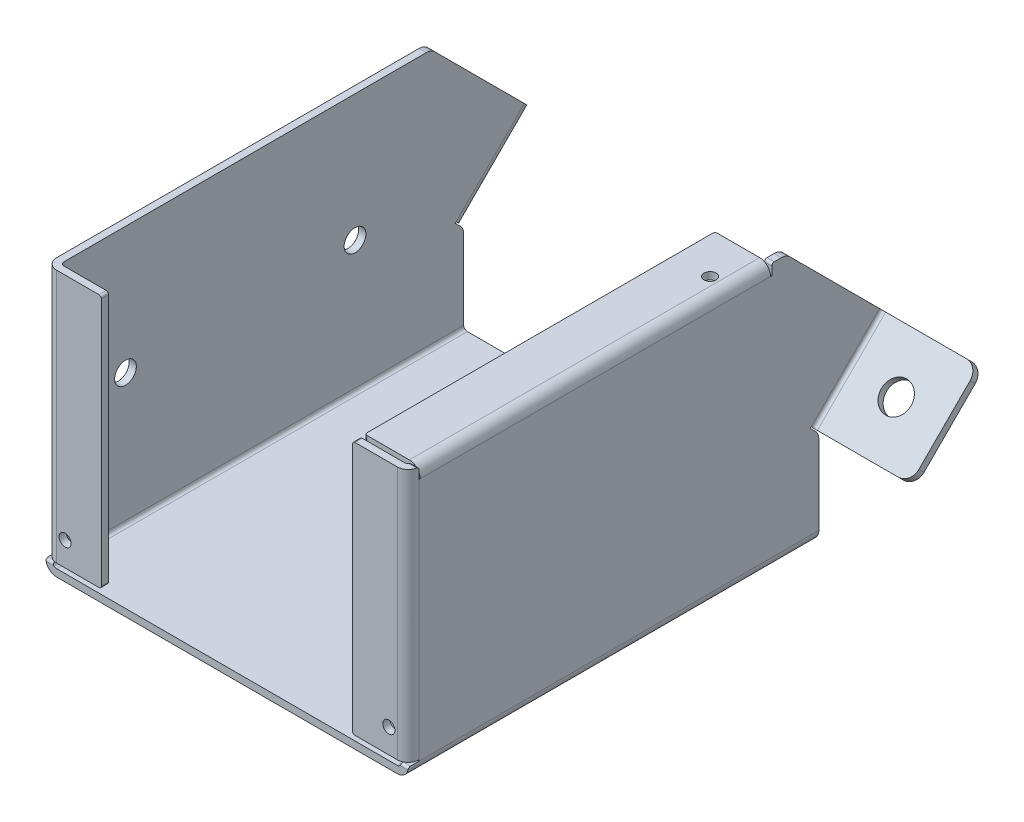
ISO-10303-21;
HEADER;
FILE_DESCRIPTION(('STEP AP214'),'2;1');
FILE_NAME('part.step','',(''),(''),'','','');
FILE_SCHEMA(('AUTOMOTIVE_DESIGN { 1 0 10303 214 1 1 1 1 }'));
ENDSEC;
DATA;
#1=APPLICATION_CONTEXT('core data for automotive mechanical design processes');
#2=APPLICATION_PROTOCOL_DEFINITION('international standard','automotive_design',2000,#1);
#3=PRODUCT_CONTEXT('',#1,'mechanical');
#4=PRODUCT('Part','Part','',(#3));
#5=PRODUCT_RELATED_PRODUCT_CATEGORY('part','',(#4));
#6=PRODUCT_DEFINITION_FORMATION('','',#4);
#7=PRODUCT_DEFINITION_CONTEXT('part definition',#1,'design');
#8=PRODUCT_DEFINITION('design','',#6,#7);
#9=PRODUCT_DEFINITION_SHAPE('','',#8);
#10=(LENGTH_UNIT() NAMED_UNIT(*) SI_UNIT(.MILLI.,.METRE.));
#11=(NAMED_UNIT(*) PLANE_ANGLE_UNIT() SI_UNIT($,.RADIAN.));
#12=(NAMED_UNIT(*) SI_UNIT($,.STERADIAN.) SOLID_ANGLE_UNIT());
#13=UNCERTAINTY_MEASURE_WITH_UNIT(LENGTH_MEASURE(1.E-05),#10,'distance_accuracy_value','');
#14=(GEOMETRIC_REPRESENTATION_CONTEXT(3) GLOBAL_UNCERTAINTY_ASSIGNED_CONTEXT((#13)) GLOBAL_UNIT_ASSIGNED_CONTEXT((#10,
#11,#12)) REPRESENTATION_CONTEXT('',''));
#15=CARTESIAN_POINT('',(0.,0.,0.));
#16=DIRECTION('',(0.,0.,1.));
#17=DIRECTION('',(1.,0.,0.));
#18=AXIS2_PLACEMENT_3D('',#15,#16,#17);
#19=CARTESIAN_POINT('',(72.,0.,0.));
#20=DIRECTION('',(-1.,0.,0.));
#21=DIRECTION('',(0.,0.,1.));
#22=AXIS2_PLACEMENT_3D('',#19,#20,#21);
#23=PLANE('',#22);
#24=DIRECTION('',(0.,0.,-1.));
#25=VECTOR('',#24,1.);
#26=CARTESIAN_POINT('',(72.,110.,0.));
#27=LINE('',#26,#25);
#28=CARTESIAN_POINT('',(72.,110.,-151.5));
#29=VERTEX_POINT('',#28);
#30=CARTESIAN_POINT('',(72.,110.,-154.497474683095));
#31=VERTEX_POINT('',#30);
#32=EDGE_CURVE('E611',#29,#31,#27,.T.);
#33=ORIENTED_EDGE('',*,*,#32,.T.);
#34=CARTESIAN_POINT('',(72.,105.,-154.497474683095));
#35=DIRECTION('',(-1.,0.,0.));
#36=DIRECTION('',(0.,0.,1.));
#37=AXIS2_PLACEMENT_3D('',#34,#35,#36);
#38=CIRCLE('',#37,5.);
#39=CARTESIAN_POINT('',(72.,108.535533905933,-158.033008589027));
#40=VERTEX_POINT('',#39);
#41=EDGE_CURVE('E897',#31,#40,#38,.T.);
#42=ORIENTED_EDGE('',*,*,#41,.T.);
#43=DIRECTION('',(0.,0.707106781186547,0.707106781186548));
#44=VECTOR('',#43,1.);
#45=CARTESIAN_POINT('',(72.,71.4662517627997,-195.10229073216));
#46=LINE('',#45,#44);
#47=CARTESIAN_POINT('',(72.,71.4662517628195,-195.102290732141));
#48=VERTEX_POINT('',#47);
#49=EDGE_CURVE('E623',#48,#40,#46,.T.);
#50=ORIENTED_EDGE('',*,*,#49,.F.);
#51=DIRECTION('',(0.,0.707106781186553,-0.707106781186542));
#52=VECTOR('',#51,1.);
#53=CARTESIAN_POINT('',(72.,43.1819805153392,-166.818019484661));
#54=LINE('',#53,#52);
#55=CARTESIAN_POINT('',(72.,43.1819805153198,-166.81801948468));
#56=VERTEX_POINT('',#55);
#57=EDGE_CURVE('E1228',#48,#56,#54,.F.);
#58=ORIENTED_EDGE('',*,*,#57,.T.);
#59=DIRECTION('',(0.,0.707106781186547,-0.707106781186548));
#60=VECTOR('',#59,1.);
#61=CARTESIAN_POINT('',(72.,39.2928932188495,-162.92893218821));
#62=LINE('',#61,#60);
#63=CARTESIAN_POINT('',(72.,42.8284271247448,-166.464466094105));
#64=VERTEX_POINT('',#63);
#65=EDGE_CURVE('E628',#64,#56,#62,.T.);
#66=ORIENTED_EDGE('',*,*,#65,.F.);
#67=DIRECTION('',(0.,-0.7071067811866,-0.707106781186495));
#68=VECTOR('',#67,1.);
#69=CARTESIAN_POINT('',(72.,104.646446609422,-104.646446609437));
#70=LINE('',#69,#68);
#71=CARTESIAN_POINT('',(72.,40.7573593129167,-168.535533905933));
#72=VERTEX_POINT('',#71);
#73=EDGE_CURVE('E602',#72,#64,#70,.F.);
#74=ORIENTED_EDGE('',*,*,#73,.F.);
#75=CARTESIAN_POINT('',(72.,37.2218254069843,-165.));
#76=DIRECTION('',(-1.,0.,0.));
#77=DIRECTION('',(0.,0.,1.));
#78=AXIS2_PLACEMENT_3D('',#75,#76,#77);
#79=CIRCLE('',#78,5.);
#80=CARTESIAN_POINT('',(72.,37.2218254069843,-170.));
#81=VERTEX_POINT('',#80);
#82=EDGE_CURVE('E890',#72,#81,#79,.T.);
#83=ORIENTED_EDGE('',*,*,#82,.T.);
#84=DIRECTION('',(0.,1.,0.));
#85=VECTOR('',#84,1.);
#86=CARTESIAN_POINT('',(72.,39.2928932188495,-170.));
#87=LINE('',#86,#85);
#88=CARTESIAN_POINT('',(72.,4.5,-170.));
#89=VERTEX_POINT('',#88);
#90=EDGE_CURVE('E585',#89,#81,#87,.T.);
#91=ORIENTED_EDGE('',*,*,#90,.F.);
#92=DIRECTION('',(0.,0.,-1.));
#93=VECTOR('',#92,1.);
#94=CARTESIAN_POINT('',(72.,4.5,0.));
#95=LINE('',#94,#93);
#96=CARTESIAN_POINT('',(72.,4.5,-4.50000000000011));
#97=VERTEX_POINT('',#96);
#98=EDGE_CURVE('E1297',#89,#97,#95,.F.);
#99=ORIENTED_EDGE('',*,*,#98,.T.);
#100=DIRECTION('',(0.,-1.,0.));
#101=VECTOR('',#100,1.);
#102=CARTESIAN_POINT('',(72.,0.,-4.50000000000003));
#103=LINE('',#102,#101);
#104=CARTESIAN_POINT('',(72.,5.00000000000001,-4.50000000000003));
#105=VERTEX_POINT('',#104);
#106=EDGE_CURVE('E518',#105,#97,#103,.T.);
#107=ORIENTED_EDGE('',*,*,#106,.F.);
#108=DIRECTION('',(0.,-1.,0.));
#109=VECTOR('',#108,1.);
#110=CARTESIAN_POINT('',(72.,0.,-4.5));
#111=LINE('',#110,#109);
#112=CARTESIAN_POINT('',(72.,105.5,-4.50000000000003));
#113=VERTEX_POINT('',#112);
#114=EDGE_CURVE('E1294',#105,#113,#111,.F.);
#115=ORIENTED_EDGE('',*,*,#114,.T.);
#116=DIRECTION('',(0.,0.,-1.));
#117=VECTOR('',#116,1.);
#118=CARTESIAN_POINT('',(72.,105.5,-4.50000000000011));
#119=LINE('',#118,#117);
#120=CARTESIAN_POINT('',(72.,105.5,-5.0000000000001));
#121=VERTEX_POINT('',#120);
#122=EDGE_CURVE('E495',#113,#121,#119,.T.);
#123=ORIENTED_EDGE('',*,*,#122,.T.);
#124=DIRECTION('',(0.,0.,1.));
#125=VECTOR('',#124,1.);
#126=CARTESIAN_POINT('',(72.,105.5,0.));
#127=LINE('',#126,#125);
#128=CARTESIAN_POINT('',(72.,105.5,-150.));
#129=VERTEX_POINT('',#128);
#130=EDGE_CURVE('E1299',#121,#129,#127,.F.);
#131=ORIENTED_EDGE('',*,*,#130,.T.);
#132=DIRECTION('',(0.,0.,-1.));
#133=VECTOR('',#132,1.);
#134=CARTESIAN_POINT('',(72.,105.5,-150.));
#135=LINE('',#134,#133);
#136=CARTESIAN_POINT('',(72.,105.5,-150.5));
#137=VERTEX_POINT('',#136);
#138=EDGE_CURVE('E464',#129,#137,#135,.T.);
#139=ORIENTED_EDGE('',*,*,#138,.T.);
#140=DIRECTION('',(0.,1.,0.));
#141=VECTOR('',#140,1.);
#142=CARTESIAN_POINT('',(72.,105.5,-150.5));
#143=LINE('',#142,#141);
#144=CARTESIAN_POINT('',(72.,109.,-150.5));
#145=VERTEX_POINT('',#144);
#146=EDGE_CURVE('E459',#137,#145,#143,.T.);
#147=ORIENTED_EDGE('',*,*,#146,.T.);
#148=CARTESIAN_POINT('',(72.,109.,-151.5));
#149=DIRECTION('',(-1.,0.,0.));
#150=DIRECTION('',(0.,0.,1.));
#151=AXIS2_PLACEMENT_3D('',#148,#149,#150);
#152=CIRCLE('',#151,1.);
#153=EDGE_CURVE('E1075',#145,#29,#152,.T.);
#154=ORIENTED_EDGE('',*,*,#153,.T.);
#155=EDGE_LOOP('',(#33,#42,#50,#58,#66,#74,#83,#91,#99,#107,#115,#123,#131,#139,#147,#154));
#156=FACE_BOUND('',#155,.T.);
#157=ADVANCED_FACE('F33',(#156),#23,.T.);
#158=CARTESIAN_POINT('',(72.,110.,0.));
#159=DIRECTION('',(0.,-1.,0.));
#160=DIRECTION('',(0.,0.,-1.));
#161=AXIS2_PLACEMENT_3D('',#158,#159,#160);
#162=PLANE('',#161);
#163=DIRECTION('',(0.,0.,-1.));
#164=VECTOR('',#163,1.);
#165=CARTESIAN_POINT('',(75.,110.,0.));
#166=LINE('',#165,#164);
#167=CARTESIAN_POINT('',(75.,110.,-151.5));
#168=VERTEX_POINT('',#167);
#169=CARTESIAN_POINT('',(75.,110.,-154.497474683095));
#170=VERTEX_POINT('',#169);
#171=EDGE_CURVE('E614',#168,#170,#166,.T.);
#172=ORIENTED_EDGE('',*,*,#171,.T.);
#173=DIRECTION('',(1.,0.,0.));
#174=VECTOR('',#173,1.);
#175=CARTESIAN_POINT('',(72.,110.,-154.497474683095));
#176=LINE('',#175,#174);
#177=EDGE_CURVE('E1056',#170,#31,#176,.F.);
#178=ORIENTED_EDGE('',*,*,#177,.T.);
#179=ORIENTED_EDGE('',*,*,#32,.F.);
#180=DIRECTION('',(1.,0.,0.));
#181=VECTOR('',#180,1.);
#182=CARTESIAN_POINT('',(72.0000000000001,110.,-151.5));
#183=LINE('',#182,#181);
#184=EDGE_CURVE('E727',#29,#168,#183,.T.);
#185=ORIENTED_EDGE('',*,*,#184,.T.);
#186=EDGE_LOOP('',(#172,#178,#179,#185));
#187=FACE_BOUND('',#186,.T.);
#188=ADVANCED_FACE('F818',(#187),#162,.F.);
#189=CARTESIAN_POINT('',(67.,110.,-133.));
#190=DIRECTION('',(0.,1.,0.));
#191=DIRECTION('',(0.,0.,1.));
#192=AXIS2_PLACEMENT_3D('',#189,#190,#191);
#193=CIRCLE('',#192,2.49999999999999);
#194=CARTESIAN_POINT('',(67.,110.,-130.5));
#195=VERTEX_POINT('',#194);
#196=EDGE_CURVE('E2185',#195,#195,#193,.T.);
#197=ORIENTED_EDGE('',*,*,#196,.F.);
#198=EDGE_LOOP('',(#197));
#199=FACE_BOUND('',#198,.T.);
#200=DIRECTION('',(1.,0.,0.));
#201=VECTOR('',#200,1.);
#202=CARTESIAN_POINT('',(-115.001025,110.,-150.));
#203=LINE('',#202,#201);
#204=CARTESIAN_POINT('',(53.,110.,-150.));
#205=VERTEX_POINT('',#204);
#206=CARTESIAN_POINT('',(70.5,110.,-150.));
#207=VERTEX_POINT('',#206);
#208=EDGE_CURVE('E479',#205,#207,#203,.T.);
#209=ORIENTED_EDGE('',*,*,#208,.F.);
#210=CARTESIAN_POINT('',(53.,110.,-149.));
#211=DIRECTION('',(0.,-1.,0.));
#212=DIRECTION('',(0.,0.,-1.));
#213=AXIS2_PLACEMENT_3D('',#210,#211,#212);
#214=CIRCLE('',#213,1.);
#215=CARTESIAN_POINT('',(52.,110.,-149.));
#216=VERTEX_POINT('',#215);
#217=EDGE_CURVE('E911',#205,#216,#214,.F.);
#218=ORIENTED_EDGE('',*,*,#217,.T.);
#219=DIRECTION('',(0.,0.,-1.));
#220=VECTOR('',#219,1.);
#221=CARTESIAN_POINT('',(52.,110.,-150.));
#222=LINE('',#221,#220);
#223=CARTESIAN_POINT('',(52.,110.,-6.00000000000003));
#224=VERTEX_POINT('',#223);
#225=EDGE_CURVE('E2175',#224,#216,#222,.T.);
#226=ORIENTED_EDGE('',*,*,#225,.F.);
#227=CARTESIAN_POINT('',(53.,110.,-6.00000000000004));
#228=DIRECTION('',(0.,-1.,0.));
#229=DIRECTION('',(0.,0.,-1.));
#230=AXIS2_PLACEMENT_3D('',#227,#228,#229);
#231=CIRCLE('',#230,1.);
#232=CARTESIAN_POINT('',(53.,110.,-5.00000000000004));
#233=VERTEX_POINT('',#232);
#234=EDGE_CURVE('E909',#224,#233,#231,.F.);
#235=ORIENTED_EDGE('',*,*,#234,.T.);
#236=DIRECTION('',(1.,0.,0.));
#237=VECTOR('',#236,1.);
#238=CARTESIAN_POINT('',(-115.001025,110.,-5.0000000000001));
#239=LINE('',#238,#237);
#240=CARTESIAN_POINT('',(70.5,110.,-5.00000000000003));
#241=VERTEX_POINT('',#240);
#242=EDGE_CURVE('E473',#233,#241,#239,.T.);
#243=ORIENTED_EDGE('',*,*,#242,.T.);
#244=DIRECTION('',(0.,0.,-1.));
#245=VECTOR('',#244,1.);
#246=CARTESIAN_POINT('',(70.5,110.,0.));
#247=LINE('',#246,#245);
#248=EDGE_CURVE('E776',#241,#207,#247,.T.);
#249=ORIENTED_EDGE('',*,*,#248,.T.);
#250=EDGE_LOOP('',(#209,#218,#226,#235,#243,#249));
#251=FACE_BOUND('',#250,.T.);
#252=ADVANCED_FACE('F824',(#199,#251),#162,.F.);
#253=CARTESIAN_POINT('',(0.,0.,0.));
#254=DIRECTION('',(0.,0.,1.));
#255=DIRECTION('',(1.,0.,0.));
#256=AXIS2_PLACEMENT_3D('',#253,#254,#255);
#257=PLANE('',#256);
#258=CARTESIAN_POINT('',(67.,15.,0.));
#259=DIRECTION('',(0.,0.,-1.));
#260=DIRECTION('',(-1.,0.,0.));
#261=AXIS2_PLACEMENT_3D('',#258,#259,#260);
#262=CIRCLE('',#261,2.49999999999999);
#263=CARTESIAN_POINT('',(64.5,15.,0.));
#264=VERTEX_POINT('',#263);
#265=EDGE_CURVE('E2182',#264,#264,#262,.T.);
#266=ORIENTED_EDGE('',*,*,#265,.T.);
#267=EDGE_LOOP('',(#266));
#268=FACE_BOUND('',#267,.T.);
#269=DIRECTION('',(-1.,0.,0.));
#270=VECTOR('',#269,1.);
#271=CARTESIAN_POINT('',(72.,110.,0.));
#272=LINE('',#271,#270);
#273=CARTESIAN_POINT('',(70.5,110.,0.));
#274=VERTEX_POINT('',#273);
#275=CARTESIAN_POINT('',(53.,110.,0.));
#276=VERTEX_POINT('',#275);
#277=EDGE_CURVE('E605',#274,#276,#272,.T.);
#278=ORIENTED_EDGE('',*,*,#277,.T.);
#279=CARTESIAN_POINT('',(53.,109.,0.));
#280=DIRECTION('',(0.,0.,1.));
#281=DIRECTION('',(1.,0.,0.));
#282=AXIS2_PLACEMENT_3D('',#279,#280,#281);
#283=CIRCLE('',#282,1.);
#284=CARTESIAN_POINT('',(52.,109.,0.));
#285=VERTEX_POINT('',#284);
#286=EDGE_CURVE('E929',#276,#285,#283,.T.);
#287=ORIENTED_EDGE('',*,*,#286,.T.);
#288=DIRECTION('',(0.,1.,0.));
#289=VECTOR('',#288,1.);
#290=CARTESIAN_POINT('',(52.,5.,0.));
#291=LINE('',#290,#289);
#292=CARTESIAN_POINT('',(52.,6.,0.));
#293=VERTEX_POINT('',#292);
#294=EDGE_CURVE('E955',#293,#285,#291,.T.);
#295=ORIENTED_EDGE('',*,*,#294,.F.);
#296=CARTESIAN_POINT('',(53.,6.,0.));
#297=DIRECTION('',(0.,0.,1.));
#298=DIRECTION('',(1.,0.,0.));
#299=AXIS2_PLACEMENT_3D('',#296,#297,#298);
#300=CIRCLE('',#299,1.);
#301=CARTESIAN_POINT('',(53.,5.,0.));
#302=VERTEX_POINT('',#301);
#303=EDGE_CURVE('E927',#293,#302,#300,.T.);
#304=ORIENTED_EDGE('',*,*,#303,.T.);
#305=DIRECTION('',(1.,0.,0.));
#306=VECTOR('',#305,1.);
#307=CARTESIAN_POINT('',(-115.000025,5.00000000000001,-1.04872488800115E-13));
#308=LINE('',#307,#306);
#309=CARTESIAN_POINT('',(70.5,5.,0.));
#310=VERTEX_POINT('',#309);
#311=EDGE_CURVE('E514',#302,#310,#308,.T.);
#312=ORIENTED_EDGE('',*,*,#311,.T.);
#313=DIRECTION('',(0.,1.,0.));
#314=VECTOR('',#313,1.);
#315=CARTESIAN_POINT('',(70.5,110.,0.));
#316=LINE('',#315,#314);
#317=EDGE_CURVE('E1130',#310,#274,#316,.T.);
#318=ORIENTED_EDGE('',*,*,#317,.T.);
#319=EDGE_LOOP('',(#278,#287,#295,#304,#312,#318));
#320=FACE_BOUND('',#319,.T.);
#321=ADVANCED_FACE('F849',(#268,#320),#257,.T.);
#322=CARTESIAN_POINT('',(75.,0.,0.));
#323=DIRECTION('',(-1.,0.,0.));
#324=DIRECTION('',(0.,0.,1.));
#325=AXIS2_PLACEMENT_3D('',#322,#323,#324);
#326=PLANE('',#325);
#327=DIRECTION('',(0.,0.707106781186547,0.707106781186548));
#328=VECTOR('',#327,1.);
#329=CARTESIAN_POINT('',(75.,71.4662517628,-195.10229073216));
#330=LINE('',#329,#328);
#331=CARTESIAN_POINT('',(75.,71.4662517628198,-195.10229073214));
#332=VERTEX_POINT('',#331);
#333=CARTESIAN_POINT('',(75.,108.535533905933,-158.033008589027));
#334=VERTEX_POINT('',#333);
#335=EDGE_CURVE('E631',#332,#334,#330,.T.);
#336=ORIENTED_EDGE('',*,*,#335,.T.);
#337=CARTESIAN_POINT('',(75.,105.,-154.497474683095));
#338=DIRECTION('',(-1.,0.,0.));
#339=DIRECTION('',(0.,0.,1.));
#340=AXIS2_PLACEMENT_3D('',#337,#338,#339);
#341=CIRCLE('',#340,5.);
#342=EDGE_CURVE('E1054',#334,#170,#341,.F.);
#343=ORIENTED_EDGE('',*,*,#342,.T.);
#344=ORIENTED_EDGE('',*,*,#171,.F.);
#345=CARTESIAN_POINT('',(75.,109.,-151.5));
#346=DIRECTION('',(-1.,0.,0.));
#347=DIRECTION('',(0.,0.,1.));
#348=AXIS2_PLACEMENT_3D('',#345,#346,#347);
#349=CIRCLE('',#348,1.);
#350=CARTESIAN_POINT('',(75.0000000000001,109.,-150.5));
#351=VERTEX_POINT('',#350);
#352=EDGE_CURVE('E478',#168,#351,#349,.F.);
#353=ORIENTED_EDGE('',*,*,#352,.T.);
#354=DIRECTION('',(0.,1.,0.));
#355=VECTOR('',#354,1.);
#356=CARTESIAN_POINT('',(75.0000000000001,105.5,-150.5));
#357=LINE('',#356,#355);
#358=CARTESIAN_POINT('',(75.0000000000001,105.5,-150.5));
#359=VERTEX_POINT('',#358);
#360=EDGE_CURVE('E456',#359,#351,#357,.T.);
#361=ORIENTED_EDGE('',*,*,#360,.F.);
#362=DIRECTION('',(0.,0.,-1.));
#363=VECTOR('',#362,1.);
#364=CARTESIAN_POINT('',(75.0000000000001,105.5,-150.));
#365=LINE('',#364,#363);
#366=CARTESIAN_POINT('',(75.0000000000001,105.5,-150.));
#367=VERTEX_POINT('',#366);
#368=EDGE_CURVE('E468',#367,#359,#365,.T.);
#369=ORIENTED_EDGE('',*,*,#368,.F.);
#370=DIRECTION('',(0.,0.,-1.));
#371=VECTOR('',#370,1.);
#372=CARTESIAN_POINT('',(75.,105.5,0.));
#373=LINE('',#372,#371);
#374=CARTESIAN_POINT('',(75.,105.5,-5.00000000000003));
#375=VERTEX_POINT('',#374);
#376=EDGE_CURVE('E1110',#367,#375,#373,.F.);
#377=ORIENTED_EDGE('',*,*,#376,.T.);
#378=DIRECTION('',(0.,0.,-1.));
#379=VECTOR('',#378,1.);
#380=CARTESIAN_POINT('',(75.,105.5,-4.50000000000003));
#381=LINE('',#380,#379);
#382=CARTESIAN_POINT('',(75.,105.5,-4.50000000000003));
#383=VERTEX_POINT('',#382);
#384=EDGE_CURVE('E488',#383,#375,#381,.T.);
#385=ORIENTED_EDGE('',*,*,#384,.F.);
#386=DIRECTION('',(0.,1.,0.));
#387=VECTOR('',#386,1.);
#388=CARTESIAN_POINT('',(75.,5.,-4.5));
#389=LINE('',#388,#387);
#390=CARTESIAN_POINT('',(75.,5.00000000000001,-4.50000000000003));
#391=VERTEX_POINT('',#390);
#392=EDGE_CURVE('E746',#383,#391,#389,.F.);
#393=ORIENTED_EDGE('',*,*,#392,.T.);
#394=DIRECTION('',(0.,1.,0.));
#395=VECTOR('',#394,1.);
#396=CARTESIAN_POINT('',(75.,4.5,-4.50000000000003));
#397=LINE('',#396,#395);
#398=CARTESIAN_POINT('',(75.,4.5,-4.50000000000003));
#399=VERTEX_POINT('',#398);
#400=EDGE_CURVE('E511',#399,#391,#397,.T.);
#401=ORIENTED_EDGE('',*,*,#400,.F.);
#402=DIRECTION('',(0.,0.,1.));
#403=VECTOR('',#402,1.);
#404=CARTESIAN_POINT('',(75.,4.5,0.));
#405=LINE('',#404,#403);
#406=CARTESIAN_POINT('',(75.,4.5,-170.));
#407=VERTEX_POINT('',#406);
#408=EDGE_CURVE('E1106',#399,#407,#405,.F.);
#409=ORIENTED_EDGE('',*,*,#408,.T.);
#410=DIRECTION('',(0.,-1.,0.));
#411=VECTOR('',#410,1.);
#412=CARTESIAN_POINT('',(75.,0.,-170.));
#413=LINE('',#412,#411);
#414=CARTESIAN_POINT('',(75.,37.2218254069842,-170.));
#415=VERTEX_POINT('',#414);
#416=EDGE_CURVE('E588',#415,#407,#413,.T.);
#417=ORIENTED_EDGE('',*,*,#416,.F.);
#418=CARTESIAN_POINT('',(75.,37.2218254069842,-165.));
#419=DIRECTION('',(-1.,0.,0.));
#420=DIRECTION('',(0.,0.,1.));
#421=AXIS2_PLACEMENT_3D('',#418,#419,#420);
#422=CIRCLE('',#421,5.);
#423=CARTESIAN_POINT('',(75.,40.7573593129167,-168.535533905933));
#424=VERTEX_POINT('',#423);
#425=EDGE_CURVE('E888',#415,#424,#422,.F.);
#426=ORIENTED_EDGE('',*,*,#425,.T.);
#427=DIRECTION('',(0.,-0.7071067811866,-0.707106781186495));
#428=VECTOR('',#427,1.);
#429=CARTESIAN_POINT('',(75.,104.646446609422,-104.646446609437));
#430=LINE('',#429,#428);
#431=CARTESIAN_POINT('',(75.,42.8284271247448,-166.464466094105));
#432=VERTEX_POINT('',#431);
#433=EDGE_CURVE('E874',#424,#432,#430,.F.);
#434=ORIENTED_EDGE('',*,*,#433,.T.);
#435=DIRECTION('',(0.,0.707106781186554,-0.707106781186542));
#436=VECTOR('',#435,1.);
#437=CARTESIAN_POINT('',(75.,39.2928932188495,-162.92893218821));
#438=LINE('',#437,#436);
#439=CARTESIAN_POINT('',(75.,43.1819805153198,-166.81801948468));
#440=VERTEX_POINT('',#439);
#441=EDGE_CURVE('E645',#432,#440,#438,.T.);
#442=ORIENTED_EDGE('',*,*,#441,.T.);
#443=DIRECTION('',(0.,-0.707106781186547,0.707106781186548));
#444=VECTOR('',#443,1.);
#445=CARTESIAN_POINT('',(75.,71.4662517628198,-195.10229073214));
#446=LINE('',#445,#444);
#447=EDGE_CURVE('E1191',#440,#332,#446,.F.);
#448=ORIENTED_EDGE('',*,*,#447,.T.);
#449=EDGE_LOOP('',(#336,#343,#344,#353,#361,#369,#377,#385,#393,#401,#409,#417,#426,#434,#442,#448));
#450=FACE_BOUND('',#449,.T.);
#451=ADVANCED_FACE('F476',(#450),#326,.F.);
#452=CARTESIAN_POINT('',(-75.,39.2928932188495,-162.92893218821));
#453=DIRECTION('',(0.,-0.707106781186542,-0.707106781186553));
#454=DIRECTION('',(0.,0.707106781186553,-0.707106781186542));
#455=AXIS2_PLACEMENT_3D('',#452,#453,#454);
#456=PLANE('',#455);
#457=ORIENTED_EDGE('',*,*,#65,.T.);
#458=DIRECTION('',(-1.,0.,0.));
#459=VECTOR('',#458,1.);
#460=CARTESIAN_POINT('',(72.,43.1819805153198,-166.81801948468));
#461=LINE('',#460,#459);
#462=EDGE_CURVE('E538',#440,#56,#461,.T.);
#463=ORIENTED_EDGE('',*,*,#462,.F.);
#464=ORIENTED_EDGE('',*,*,#441,.F.);
#465=DIRECTION('',(-1.,0.,0.));
#466=VECTOR('',#465,1.);
#467=CARTESIAN_POINT('',(75.,42.8284271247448,-166.464466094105));
#468=LINE('',#467,#466);
#469=EDGE_CURVE('E879',#64,#432,#468,.F.);
#470=ORIENTED_EDGE('',*,*,#469,.F.);
#471=EDGE_LOOP('',(#457,#463,#464,#470));
#472=FACE_BOUND('',#471,.T.);
#473=ADVANCED_FACE('F848',(#472),#456,.T.);
#474=CARTESIAN_POINT('',(-72.,0.,0.));
#475=DIRECTION('',(-1.,0.,0.));
#476=DIRECTION('',(0.,0.,1.));
#477=AXIS2_PLACEMENT_3D('',#474,#475,#476);
#478=PLANE('',#477);
#479=CARTESIAN_POINT('',(-72.,57.5,-30.));
#480=DIRECTION('',(-1.,0.,0.));
#481=DIRECTION('',(0.,0.,1.));
#482=AXIS2_PLACEMENT_3D('',#479,#480,#481);
#483=CIRCLE('',#482,4.49999999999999);
#484=CARTESIAN_POINT('',(-72.,57.5,-25.5));
#485=VERTEX_POINT('',#484);
#486=EDGE_CURVE('E2120',#485,#485,#483,.T.);
#487=ORIENTED_EDGE('',*,*,#486,.T.);
#488=EDGE_LOOP('',(#487));
#489=FACE_BOUND('',#488,.T.);
#490=CARTESIAN_POINT('',(-72.,57.5,-125.));
#491=DIRECTION('',(-1.,0.,0.));
#492=DIRECTION('',(0.,0.,1.));
#493=AXIS2_PLACEMENT_3D('',#490,#491,#492);
#494=CIRCLE('',#493,4.49999999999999);
#495=CARTESIAN_POINT('',(-72.,57.5,-120.5));
#496=VERTEX_POINT('',#495);
#497=EDGE_CURVE('E2123',#496,#496,#494,.T.);
#498=ORIENTED_EDGE('',*,*,#497,.T.);
#499=EDGE_LOOP('',(#498));
#500=FACE_BOUND('',#499,.T.);
#501=DIRECTION('',(0.,0.707106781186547,0.707106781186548));
#502=VECTOR('',#501,1.);
#503=CARTESIAN_POINT('',(-72.,71.4662517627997,-195.10229073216));
#504=LINE('',#503,#502);
#505=CARTESIAN_POINT('',(-72.,71.4662517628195,-195.102290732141));
#506=VERTEX_POINT('',#505);
#507=CARTESIAN_POINT('',(-72.,108.535533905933,-158.033008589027));
#508=VERTEX_POINT('',#507);
#509=EDGE_CURVE('E624',#506,#508,#504,.T.);
#510=ORIENTED_EDGE('',*,*,#509,.T.);
#511=CARTESIAN_POINT('',(-72.,105.,-154.497474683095));
#512=DIRECTION('',(-1.,0.,0.));
#513=DIRECTION('',(0.,0.,1.));
#514=AXIS2_PLACEMENT_3D('',#511,#512,#513);
#515=CIRCLE('',#514,5.);
#516=CARTESIAN_POINT('',(-72.,110.,-154.497474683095));
#517=VERTEX_POINT('',#516);
#518=EDGE_CURVE('E997',#508,#517,#515,.F.);
#519=ORIENTED_EDGE('',*,*,#518,.T.);
#520=DIRECTION('',(0.,0.,-1.));
#521=VECTOR('',#520,1.);
#522=CARTESIAN_POINT('',(-72.,110.,0.));
#523=LINE('',#522,#521);
#524=CARTESIAN_POINT('',(-72.,110.,-4.5));
#525=VERTEX_POINT('',#524);
#526=EDGE_CURVE('E620',#525,#517,#523,.T.);
#527=ORIENTED_EDGE('',*,*,#526,.F.);
#528=DIRECTION('',(0.,1.,0.));
#529=VECTOR('',#528,1.);
#530=CARTESIAN_POINT('',(-72.,5.,-4.5));
#531=LINE('',#530,#529);
#532=CARTESIAN_POINT('',(-72.,5.,-4.49999999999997));
#533=VERTEX_POINT('',#532);
#534=EDGE_CURVE('E1301',#525,#533,#531,.F.);
#535=ORIENTED_EDGE('',*,*,#534,.T.);
#536=DIRECTION('',(0.,1.,0.));
#537=VECTOR('',#536,1.);
#538=CARTESIAN_POINT('',(-72.,5.,-4.49999999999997));
#539=LINE('',#538,#537);
#540=CARTESIAN_POINT('',(-72.,4.5,-4.49999999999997));
#541=VERTEX_POINT('',#540);
#542=EDGE_CURVE('E548',#541,#533,#539,.T.);
#543=ORIENTED_EDGE('',*,*,#542,.F.);
#544=DIRECTION('',(0.,0.,-1.));
#545=VECTOR('',#544,1.);
#546=CARTESIAN_POINT('',(-72.,4.5,-170.));
#547=LINE('',#546,#545);
#548=CARTESIAN_POINT('',(-72.,4.5,-170.));
#549=VERTEX_POINT('',#548);
#550=EDGE_CURVE('E1087',#541,#549,#547,.T.);
#551=ORIENTED_EDGE('',*,*,#550,.T.);
#552=DIRECTION('',(0.,-1.,0.));
#553=VECTOR('',#552,1.);
#554=CARTESIAN_POINT('',(-72.,3.,-170.));
#555=LINE('',#554,#553);
#556=CARTESIAN_POINT('',(-72.,37.2218254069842,-170.));
#557=VERTEX_POINT('',#556);
#558=EDGE_CURVE('E596',#557,#549,#555,.T.);
#559=ORIENTED_EDGE('',*,*,#558,.F.);
#560=CARTESIAN_POINT('',(-72.,37.2218254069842,-165.));
#561=DIRECTION('',(-1.,0.,0.));
#562=DIRECTION('',(0.,0.,1.));
#563=AXIS2_PLACEMENT_3D('',#560,#561,#562);
#564=CIRCLE('',#563,5.);
#565=CARTESIAN_POINT('',(-72.,40.7573593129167,-168.535533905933));
#566=VERTEX_POINT('',#565);
#567=EDGE_CURVE('E1001',#557,#566,#564,.F.);
#568=ORIENTED_EDGE('',*,*,#567,.T.);
#569=DIRECTION('',(0.,-0.7071067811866,-0.707106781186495));
#570=VECTOR('',#569,1.);
#571=CARTESIAN_POINT('',(-72.,104.646446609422,-104.646446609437));
#572=LINE('',#571,#570);
#573=CARTESIAN_POINT('',(-72.,42.8284271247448,-166.464466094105));
#574=VERTEX_POINT('',#573);
#575=EDGE_CURVE('E598',#566,#574,#572,.F.);
#576=ORIENTED_EDGE('',*,*,#575,.T.);
#577=DIRECTION('',(0.,0.707106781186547,-0.707106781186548));
#578=VECTOR('',#577,1.);
#579=CARTESIAN_POINT('',(-72.,39.2928932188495,-162.92893218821));
#580=LINE('',#579,#578);
#581=CARTESIAN_POINT('',(-72.,43.1819805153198,-166.81801948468));
#582=VERTEX_POINT('',#581);
#583=EDGE_CURVE('E627',#574,#582,#580,.T.);
#584=ORIENTED_EDGE('',*,*,#583,.T.);
#585=DIRECTION('',(0.,-0.707106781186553,0.707106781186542));
#586=VECTOR('',#585,1.);
#587=CARTESIAN_POINT('',(-72.,-61.8180194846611,-61.8180194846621));
#588=LINE('',#587,#586);
#589=EDGE_CURVE('E1175',#582,#506,#588,.F.);
#590=ORIENTED_EDGE('',*,*,#589,.T.);
#591=EDGE_LOOP('',(#510,#519,#527,#535,#543,#551,#559,#568,#576,#584,#590));
#592=FACE_BOUND('',#591,.T.);
#593=ADVANCED_FACE('F830',(#489,#500,#592),#478,.F.);
#594=DIRECTION('',(1.,0.,0.));
#595=VECTOR('',#594,1.);
#596=CARTESIAN_POINT('',(75.,0.,0.));
#597=LINE('',#596,#595);
#598=CARTESIAN_POINT('',(-70.5,0.,0.));
#599=VERTEX_POINT('',#598);
#600=CARTESIAN_POINT('',(70.5,0.,0.));
#601=VERTEX_POINT('',#600);
#602=EDGE_CURVE('E601',#599,#601,#597,.T.);
#603=ORIENTED_EDGE('',*,*,#602,.T.);
#604=CARTESIAN_POINT('',(70.5,4.5,0.));
#605=DIRECTION('',(0.,0.,1.));
#606=DIRECTION('',(1.,0.,0.));
#607=AXIS2_PLACEMENT_3D('',#604,#605,#606);
#608=CIRCLE('',#607,4.5);
#609=CARTESIAN_POINT('',(74.887482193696,3.5,0.));
#610=VERTEX_POINT('',#609);
#611=EDGE_CURVE('E747',#601,#610,#608,.T.);
#612=ORIENTED_EDGE('',*,*,#611,.T.);
#613=DIRECTION('',(1.,0.,0.));
#614=VECTOR('',#613,1.);
#615=CARTESIAN_POINT('',(72.,3.5,0.));
#616=LINE('',#615,#614);
#617=CARTESIAN_POINT('',(71.6180339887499,3.5,0.));
#618=VERTEX_POINT('',#617);
#619=EDGE_CURVE('E728',#610,#618,#616,.F.);
#620=ORIENTED_EDGE('',*,*,#619,.T.);
#621=CARTESIAN_POINT('',(70.5,4.5,0.));
#622=DIRECTION('',(0.,0.,1.));
#623=DIRECTION('',(1.,0.,0.));
#624=AXIS2_PLACEMENT_3D('',#621,#622,#623);
#625=CIRCLE('',#624,1.5);
#626=CARTESIAN_POINT('',(70.5,3.,0.));
#627=VERTEX_POINT('',#626);
#628=EDGE_CURVE('E683',#618,#627,#625,.F.);
#629=ORIENTED_EDGE('',*,*,#628,.T.);
#630=DIRECTION('',(-1.,0.,0.));
#631=VECTOR('',#630,1.);
#632=CARTESIAN_POINT('',(-72.,3.,0.));
#633=LINE('',#632,#631);
#634=CARTESIAN_POINT('',(-70.5,3.,0.));
#635=VERTEX_POINT('',#634);
#636=EDGE_CURVE('E608',#627,#635,#633,.T.);
#637=ORIENTED_EDGE('',*,*,#636,.T.);
#638=CARTESIAN_POINT('',(-70.5,4.5,0.));
#639=DIRECTION('',(0.,0.,1.));
#640=DIRECTION('',(1.,0.,0.));
#641=AXIS2_PLACEMENT_3D('',#638,#639,#640);
#642=CIRCLE('',#641,1.5);
#643=CARTESIAN_POINT('',(-71.6180339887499,3.5,0.));
#644=VERTEX_POINT('',#643);
#645=EDGE_CURVE('E663',#635,#644,#642,.F.);
#646=ORIENTED_EDGE('',*,*,#645,.T.);
#647=DIRECTION('',(-1.,0.,0.));
#648=VECTOR('',#647,1.);
#649=CARTESIAN_POINT('',(-75.,3.5,0.));
#650=LINE('',#649,#648);
#651=CARTESIAN_POINT('',(-74.887482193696,3.5,0.));
#652=VERTEX_POINT('',#651);
#653=EDGE_CURVE('E1091',#644,#652,#650,.T.);
#654=ORIENTED_EDGE('',*,*,#653,.T.);
#655=CARTESIAN_POINT('',(-70.5,4.5,0.));
#656=DIRECTION('',(0.,0.,1.));
#657=DIRECTION('',(1.,0.,0.));
#658=AXIS2_PLACEMENT_3D('',#655,#656,#657);
#659=CIRCLE('',#658,4.5);
#660=EDGE_CURVE('E1172',#652,#599,#659,.T.);
#661=ORIENTED_EDGE('',*,*,#660,.T.);
#662=EDGE_LOOP('',(#603,#612,#620,#629,#637,#646,#654,#661));
#663=FACE_BOUND('',#662,.T.);
#664=ADVANCED_FACE('F854',(#663),#257,.T.);
#665=DIRECTION('',(0.,0.707106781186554,-0.707106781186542));
#666=VECTOR('',#665,1.);
#667=CARTESIAN_POINT('',(-75.,39.2928932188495,-162.92893218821));
#668=LINE('',#667,#666);
#669=CARTESIAN_POINT('',(-75.,42.8284271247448,-166.464466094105));
#670=VERTEX_POINT('',#669);
#671=CARTESIAN_POINT('',(-75.,43.1819805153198,-166.81801948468));
#672=VERTEX_POINT('',#671);
#673=EDGE_CURVE('E638',#670,#672,#668,.T.);
#674=ORIENTED_EDGE('',*,*,#673,.T.);
#675=DIRECTION('',(-1.,0.,0.));
#676=VECTOR('',#675,1.);
#677=CARTESIAN_POINT('',(-75.,43.1819805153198,-166.81801948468));
#678=LINE('',#677,#676);
#679=EDGE_CURVE('E576',#582,#672,#678,.T.);
#680=ORIENTED_EDGE('',*,*,#679,.F.);
#681=ORIENTED_EDGE('',*,*,#583,.F.);
#682=DIRECTION('',(-1.,0.,0.));
#683=VECTOR('',#682,1.);
#684=CARTESIAN_POINT('',(-72.,42.8284271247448,-166.464466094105));
#685=LINE('',#684,#683);
#686=EDGE_CURVE('E1155',#670,#574,#685,.F.);
#687=ORIENTED_EDGE('',*,*,#686,.F.);
#688=EDGE_LOOP('',(#674,#680,#681,#687));
#689=FACE_BOUND('',#688,.T.);
#690=ADVANCED_FACE('F850',(#689),#456,.T.);
#691=CARTESIAN_POINT('',(-75.,71.4662517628,-195.10229073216));
#692=DIRECTION('',(0.,0.707106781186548,-0.707106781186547));
#693=DIRECTION('',(0.,0.707106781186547,0.707106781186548));
#694=AXIS2_PLACEMENT_3D('',#691,#692,#693);
#695=PLANE('',#694);
#696=ORIENTED_EDGE('',*,*,#49,.T.);
#697=DIRECTION('',(1.,0.,0.));
#698=VECTOR('',#697,1.);
#699=CARTESIAN_POINT('',(75.,108.535533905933,-158.033008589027));
#700=LINE('',#699,#698);
#701=EDGE_CURVE('E1050',#40,#334,#700,.T.);
#702=ORIENTED_EDGE('',*,*,#701,.T.);
#703=ORIENTED_EDGE('',*,*,#335,.F.);
#704=CARTESIAN_POINT('',(76.5,71.4662517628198,-195.10229073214));
#705=DIRECTION('',(0.,0.707106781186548,-0.707106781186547));
#706=DIRECTION('',(0.,0.707106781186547,0.707106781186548));
#707=AXIS2_PLACEMENT_3D('',#704,#705,#706);
#708=CIRCLE('',#707,1.5);
#709=CARTESIAN_POINT('',(76.5,70.40559159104,-196.16295090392));
#710=VERTEX_POINT('',#709);
#711=EDGE_CURVE('E668',#332,#710,#708,.F.);
#712=ORIENTED_EDGE('',*,*,#711,.T.);
#713=DIRECTION('',(-1.,0.,0.));
#714=VECTOR('',#713,1.);
#715=CARTESIAN_POINT('',(115.,70.40559159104,-196.16295090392));
#716=LINE('',#715,#714);
#717=CARTESIAN_POINT('',(110.,70.40559159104,-196.16295090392));
#718=VERTEX_POINT('',#717);
#719=EDGE_CURVE('E544',#718,#710,#716,.T.);
#720=ORIENTED_EDGE('',*,*,#719,.F.);
#721=DIRECTION('',(0.,0.707106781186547,0.707106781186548));
#722=VECTOR('',#721,1.);
#723=CARTESIAN_POINT('',(110.,68.28427124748,-198.28427124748));
#724=LINE('',#723,#722);
#725=CARTESIAN_POINT('',(110.,68.28427124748,-198.28427124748));
#726=VERTEX_POINT('',#725);
#727=EDGE_CURVE('E1048',#718,#726,#724,.F.);
#728=ORIENTED_EDGE('',*,*,#727,.T.);
#729=DIRECTION('',(1.,0.,0.));
#730=VECTOR('',#729,1.);
#731=CARTESIAN_POINT('',(75.,68.28427124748,-198.28427124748));
#732=LINE('',#731,#730);
#733=CARTESIAN_POINT('',(76.5,68.28427124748,-198.28427124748));
#734=VERTEX_POINT('',#733);
#735=EDGE_CURVE('E537',#734,#726,#732,.T.);
#736=ORIENTED_EDGE('',*,*,#735,.F.);
#737=CARTESIAN_POINT('',(76.5,71.4662517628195,-195.102290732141));
#738=DIRECTION('',(0.,0.707106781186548,-0.707106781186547));
#739=DIRECTION('',(0.,0.707106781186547,0.707106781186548));
#740=AXIS2_PLACEMENT_3D('',#737,#738,#739);
#741=CIRCLE('',#740,4.5);
#742=EDGE_CURVE('E1068',#734,#48,#741,.T.);
#743=ORIENTED_EDGE('',*,*,#742,.T.);
#744=EDGE_LOOP('',(#696,#702,#703,#712,#720,#728,#736,#743));
#745=FACE_BOUND('',#744,.T.);
#746=ADVANCED_FACE('F853',(#745),#695,.T.);
#747=DIRECTION('',(0.,0.707106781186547,0.707106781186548));
#748=VECTOR('',#747,1.);
#749=CARTESIAN_POINT('',(-75.,71.4662517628,-195.10229073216));
#750=LINE('',#749,#748);
#751=CARTESIAN_POINT('',(-75.,71.4662517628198,-195.10229073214));
#752=VERTEX_POINT('',#751);
#753=CARTESIAN_POINT('',(-75.,108.535533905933,-158.033008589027));
#754=VERTEX_POINT('',#753);
#755=EDGE_CURVE('E641',#752,#754,#750,.T.);
#756=ORIENTED_EDGE('',*,*,#755,.T.);
#757=DIRECTION('',(1.,0.,0.));
#758=VECTOR('',#757,1.);
#759=CARTESIAN_POINT('',(-72.,108.535533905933,-158.033008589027));
#760=LINE('',#759,#758);
#761=EDGE_CURVE('E1134',#754,#508,#760,.T.);
#762=ORIENTED_EDGE('',*,*,#761,.T.);
#763=ORIENTED_EDGE('',*,*,#509,.F.);
#764=CARTESIAN_POINT('',(-76.5,71.4662517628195,-195.102290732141));
#765=DIRECTION('',(0.,0.707106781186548,-0.707106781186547));
#766=DIRECTION('',(0.,0.707106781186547,0.707106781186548));
#767=AXIS2_PLACEMENT_3D('',#764,#765,#766);
#768=CIRCLE('',#767,4.5);
#769=CARTESIAN_POINT('',(-76.5,68.28427124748,-198.28427124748));
#770=VERTEX_POINT('',#769);
#771=EDGE_CURVE('E1170',#506,#770,#768,.T.);
#772=ORIENTED_EDGE('',*,*,#771,.T.);
#773=DIRECTION('',(1.,0.,0.));
#774=VECTOR('',#773,1.);
#775=CARTESIAN_POINT('',(-72.,68.28427124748,-198.28427124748));
#776=LINE('',#775,#774);
#777=CARTESIAN_POINT('',(-110.,68.28427124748,-198.28427124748));
#778=VERTEX_POINT('',#777);
#779=EDGE_CURVE('E573',#778,#770,#776,.T.);
#780=ORIENTED_EDGE('',*,*,#779,.F.);
#781=DIRECTION('',(0.,-0.707106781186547,-0.707106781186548));
#782=VECTOR('',#781,1.);
#783=CARTESIAN_POINT('',(-110.,70.40559159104,-196.16295090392));
#784=LINE('',#783,#782);
#785=CARTESIAN_POINT('',(-110.,70.40559159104,-196.16295090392));
#786=VERTEX_POINT('',#785);
#787=EDGE_CURVE('E1131',#778,#786,#784,.F.);
#788=ORIENTED_EDGE('',*,*,#787,.T.);
#789=DIRECTION('',(1.,0.,0.));
#790=VECTOR('',#789,1.);
#791=CARTESIAN_POINT('',(-115.,70.40559159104,-196.16295090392));
#792=LINE('',#791,#790);
#793=CARTESIAN_POINT('',(-76.5,70.40559159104,-196.16295090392));
#794=VERTEX_POINT('',#793);
#795=EDGE_CURVE('E572',#786,#794,#792,.T.);
#796=ORIENTED_EDGE('',*,*,#795,.T.);
#797=CARTESIAN_POINT('',(-76.5,71.4662517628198,-195.10229073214));
#798=DIRECTION('',(0.,0.707106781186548,-0.707106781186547));
#799=DIRECTION('',(0.,0.707106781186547,0.707106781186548));
#800=AXIS2_PLACEMENT_3D('',#797,#798,#799);
#801=CIRCLE('',#800,1.5);
#802=EDGE_CURVE('E671',#794,#752,#801,.F.);
#803=ORIENTED_EDGE('',*,*,#802,.T.);
#804=EDGE_LOOP('',(#756,#762,#763,#772,#780,#788,#796,#803));
#805=FACE_BOUND('',#804,.T.);
#806=ADVANCED_FACE('F844',(#805),#695,.T.);
#807=CARTESIAN_POINT('',(-75.,0.,0.));
#808=DIRECTION('',(-1.,0.,0.));
#809=DIRECTION('',(0.,0.,1.));
#810=AXIS2_PLACEMENT_3D('',#807,#808,#809);
#811=PLANE('',#810);
#812=CARTESIAN_POINT('',(-75.,57.5,-30.));
#813=DIRECTION('',(-1.,0.,0.));
#814=DIRECTION('',(0.,0.,1.));
#815=AXIS2_PLACEMENT_3D('',#812,#813,#814);
#816=CIRCLE('',#815,4.49999999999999);
#817=CARTESIAN_POINT('',(-75.,57.5,-25.5));
#818=VERTEX_POINT('',#817);
#819=EDGE_CURVE('E1281',#818,#818,#816,.T.);
#820=ORIENTED_EDGE('',*,*,#819,.F.);
#821=EDGE_LOOP('',(#820));
#822=FACE_BOUND('',#821,.T.);
#823=CARTESIAN_POINT('',(-74.9999999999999,57.5,-125.));
#824=DIRECTION('',(-1.,0.,0.));
#825=DIRECTION('',(0.,0.,1.));
#826=AXIS2_PLACEMENT_3D('',#823,#824,#825);
#827=CIRCLE('',#826,4.49999999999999);
#828=CARTESIAN_POINT('',(-74.9999999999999,57.5,-120.5));
#829=VERTEX_POINT('',#828);
#830=EDGE_CURVE('E2125',#829,#829,#827,.T.);
#831=ORIENTED_EDGE('',*,*,#830,.F.);
#832=EDGE_LOOP('',(#831));
#833=FACE_BOUND('',#832,.T.);
#834=DIRECTION('',(0.,0.,-1.));
#835=VECTOR('',#834,1.);
#836=CARTESIAN_POINT('',(-75.,110.,0.));
#837=LINE('',#836,#835);
#838=CARTESIAN_POINT('',(-75.,110.,-4.5));
#839=VERTEX_POINT('',#838);
#840=CARTESIAN_POINT('',(-75.,110.,-154.497474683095));
#841=VERTEX_POINT('',#840);
#842=EDGE_CURVE('E617',#839,#841,#837,.T.);
#843=ORIENTED_EDGE('',*,*,#842,.T.);
#844=CARTESIAN_POINT('',(-75.,105.,-154.497474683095));
#845=DIRECTION('',(-1.,0.,0.));
#846=DIRECTION('',(0.,0.,1.));
#847=AXIS2_PLACEMENT_3D('',#844,#845,#846);
#848=CIRCLE('',#847,5.);
#849=EDGE_CURVE('E999',#841,#754,#848,.T.);
#850=ORIENTED_EDGE('',*,*,#849,.T.);
#851=ORIENTED_EDGE('',*,*,#755,.F.);
#852=DIRECTION('',(0.,0.707106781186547,-0.707106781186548));
#853=VECTOR('',#852,1.);
#854=CARTESIAN_POINT('',(-75.,-61.8180194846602,-61.8180194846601));
#855=LINE('',#854,#853);
#856=EDGE_CURVE('E648',#752,#672,#855,.F.);
#857=ORIENTED_EDGE('',*,*,#856,.T.);
#858=ORIENTED_EDGE('',*,*,#673,.F.);
#859=DIRECTION('',(0.,-0.7071067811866,-0.707106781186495));
#860=VECTOR('',#859,1.);
#861=CARTESIAN_POINT('',(-75.,104.646446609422,-104.646446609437));
#862=LINE('',#861,#860);
#863=CARTESIAN_POINT('',(-75.,40.7573593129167,-168.535533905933));
#864=VERTEX_POINT('',#863);
#865=EDGE_CURVE('E882',#864,#670,#862,.F.);
#866=ORIENTED_EDGE('',*,*,#865,.F.);
#867=CARTESIAN_POINT('',(-75.,37.2218254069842,-165.));
#868=DIRECTION('',(-1.,0.,0.));
#869=DIRECTION('',(0.,0.,1.));
#870=AXIS2_PLACEMENT_3D('',#867,#868,#869);
#871=CIRCLE('',#870,5.);
#872=CARTESIAN_POINT('',(-75.,37.2218254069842,-170.));
#873=VERTEX_POINT('',#872);
#874=EDGE_CURVE('E996',#864,#873,#871,.T.);
#875=ORIENTED_EDGE('',*,*,#874,.T.);
#876=DIRECTION('',(0.,1.,0.));
#877=VECTOR('',#876,1.);
#878=CARTESIAN_POINT('',(-75.,39.2928932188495,-170.));
#879=LINE('',#878,#877);
#880=CARTESIAN_POINT('',(-75.,4.5,-170.));
#881=VERTEX_POINT('',#880);
#882=EDGE_CURVE('E593',#881,#873,#879,.T.);
#883=ORIENTED_EDGE('',*,*,#882,.F.);
#884=DIRECTION('',(0.,0.,-1.));
#885=VECTOR('',#884,1.);
#886=CARTESIAN_POINT('',(-75.,4.5,0.));
#887=LINE('',#886,#885);
#888=CARTESIAN_POINT('',(-75.,4.5,-4.49999999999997));
#889=VERTEX_POINT('',#888);
#890=EDGE_CURVE('E981',#881,#889,#887,.F.);
#891=ORIENTED_EDGE('',*,*,#890,.T.);
#892=DIRECTION('',(0.,-1.,0.));
#893=VECTOR('',#892,1.);
#894=CARTESIAN_POINT('',(-75.,5.,-4.49999999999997));
#895=LINE('',#894,#893);
#896=CARTESIAN_POINT('',(-75.,5.,-4.49999999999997));
#897=VERTEX_POINT('',#896);
#898=EDGE_CURVE('E555',#897,#889,#895,.T.);
#899=ORIENTED_EDGE('',*,*,#898,.F.);
#900=DIRECTION('',(0.,-1.,0.));
#901=VECTOR('',#900,1.);
#902=CARTESIAN_POINT('',(-75.,0.,-4.5));
#903=LINE('',#902,#901);
#904=EDGE_CURVE('E987',#897,#839,#903,.F.);
#905=ORIENTED_EDGE('',*,*,#904,.T.);
#906=EDGE_LOOP('',(#843,#850,#851,#857,#858,#866,#875,#883,#891,#899,#905));
#907=FACE_BOUND('',#906,.T.);
#908=ADVANCED_FACE('F840',(#822,#833,#907),#811,.T.);
#909=CARTESIAN_POINT('',(0.,0.,0.));
#910=DIRECTION('',(0.,1.,0.));
#911=DIRECTION('',(0.,0.,1.));
#912=AXIS2_PLACEMENT_3D('',#909,#910,#911);
#913=PLANE('',#912);
#914=DIRECTION('',(-1.,0.,0.));
#915=VECTOR('',#914,1.);
#916=CARTESIAN_POINT('',(-75.,0.,-170.));
#917=LINE('',#916,#915);
#918=CARTESIAN_POINT('',(70.5,0.,-170.));
#919=VERTEX_POINT('',#918);
#920=CARTESIAN_POINT('',(-70.5,0.,-170.));
#921=VERTEX_POINT('',#920);
#922=EDGE_CURVE('E590',#919,#921,#917,.T.);
#923=ORIENTED_EDGE('',*,*,#922,.F.);
#924=DIRECTION('',(0.,0.,1.));
#925=VECTOR('',#924,1.);
#926=CARTESIAN_POINT('',(70.5,0.,0.));
#927=LINE('',#926,#925);
#928=EDGE_CURVE('E1169',#919,#601,#927,.T.);
#929=ORIENTED_EDGE('',*,*,#928,.T.);
#930=ORIENTED_EDGE('',*,*,#602,.F.);
#931=DIRECTION('',(0.,0.,-1.));
#932=VECTOR('',#931,1.);
#933=CARTESIAN_POINT('',(-70.5,0.,-170.));
#934=LINE('',#933,#932);
#935=EDGE_CURVE('E1166',#599,#921,#934,.T.);
#936=ORIENTED_EDGE('',*,*,#935,.T.);
#937=EDGE_LOOP('',(#923,#929,#930,#936));
#938=FACE_BOUND('',#937,.T.);
#939=ADVANCED_FACE('F836',(#938),#913,.F.);
#940=CARTESIAN_POINT('',(-72.,3.,-156.56854249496));
#941=DIRECTION('',(0.,-1.,0.));
#942=DIRECTION('',(0.,0.,-1.));
#943=AXIS2_PLACEMENT_3D('',#940,#941,#942);
#944=PLANE('',#943);
#945=DIRECTION('',(1.,0.,0.));
#946=VECTOR('',#945,1.);
#947=CARTESIAN_POINT('',(72.,3.,-170.));
#948=LINE('',#947,#946);
#949=CARTESIAN_POINT('',(-70.5,3.,-170.));
#950=VERTEX_POINT('',#949);
#951=CARTESIAN_POINT('',(70.5,3.,-170.));
#952=VERTEX_POINT('',#951);
#953=EDGE_CURVE('E579',#950,#952,#948,.T.);
#954=ORIENTED_EDGE('',*,*,#953,.F.);
#955=DIRECTION('',(0.,0.,-1.));
#956=VECTOR('',#955,1.);
#957=CARTESIAN_POINT('',(-70.5,3.,0.));
#958=LINE('',#957,#956);
#959=EDGE_CURVE('E1187',#950,#635,#958,.F.);
#960=ORIENTED_EDGE('',*,*,#959,.T.);
#961=ORIENTED_EDGE('',*,*,#636,.F.);
#962=DIRECTION('',(0.,0.,-1.));
#963=VECTOR('',#962,1.);
#964=CARTESIAN_POINT('',(70.5,3.,-156.56854249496));
#965=LINE('',#964,#963);
#966=EDGE_CURVE('E1183',#627,#952,#965,.T.);
#967=ORIENTED_EDGE('',*,*,#966,.T.);
#968=EDGE_LOOP('',(#954,#960,#961,#967));
#969=FACE_BOUND('',#968,.T.);
#970=ADVANCED_FACE('F832',(#969),#944,.F.);
#971=CARTESIAN_POINT('',(-75.,110.,0.));
#972=DIRECTION('',(0.,-1.,0.));
#973=DIRECTION('',(0.,0.,-1.));
#974=AXIS2_PLACEMENT_3D('',#971,#972,#973);
#975=PLANE('',#974);
#976=DIRECTION('',(-1.,0.,0.));
#977=VECTOR('',#976,1.);
#978=CARTESIAN_POINT('',(-75.,110.,0.));
#979=LINE('',#978,#977);
#980=CARTESIAN_POINT('',(-53.,110.,0.));
#981=VERTEX_POINT('',#980);
#982=CARTESIAN_POINT('',(-70.5,110.,0.));
#983=VERTEX_POINT('',#982);
#984=EDGE_CURVE('E599',#981,#983,#979,.T.);
#985=ORIENTED_EDGE('',*,*,#984,.F.);
#986=DIRECTION('',(0.,0.,1.));
#987=VECTOR('',#986,1.);
#988=CARTESIAN_POINT('',(-53.,110.,-3.));
#989=LINE('',#988,#987);
#990=CARTESIAN_POINT('',(-53.,110.,-3.));
#991=VERTEX_POINT('',#990);
#992=EDGE_CURVE('E11',#981,#991,#989,.F.);
#993=ORIENTED_EDGE('',*,*,#992,.T.);
#994=DIRECTION('',(-1.,0.,0.));
#995=VECTOR('',#994,1.);
#996=CARTESIAN_POINT('',(-60.,110.,-3.));
#997=LINE('',#996,#995);
#998=CARTESIAN_POINT('',(-70.5,110.,-3.));
#999=VERTEX_POINT('',#998);
#1000=EDGE_CURVE('E541',#991,#999,#997,.T.);
#1001=ORIENTED_EDGE('',*,*,#1000,.T.);
#1002=CARTESIAN_POINT('',(-70.5,110.,-4.5));
#1003=DIRECTION('',(0.,-1.,0.));
#1004=DIRECTION('',(0.,0.,-1.));
#1005=AXIS2_PLACEMENT_3D('',#1002,#1003,#1004);
#1006=CIRCLE('',#1005,1.5);
#1007=EDGE_CURVE('E676',#999,#525,#1006,.T.);
#1008=ORIENTED_EDGE('',*,*,#1007,.T.);
#1009=ORIENTED_EDGE('',*,*,#526,.T.);
#1010=DIRECTION('',(1.,0.,0.));
#1011=VECTOR('',#1010,1.);
#1012=CARTESIAN_POINT('',(-75.,110.,-154.497474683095));
#1013=LINE('',#1012,#1011);
#1014=EDGE_CURVE('E993',#517,#841,#1013,.F.);
#1015=ORIENTED_EDGE('',*,*,#1014,.T.);
#1016=ORIENTED_EDGE('',*,*,#842,.F.);
#1017=CARTESIAN_POINT('',(-70.5,110.,-4.5));
#1018=DIRECTION('',(0.,-1.,0.));
#1019=DIRECTION('',(0.,0.,-1.));
#1020=AXIS2_PLACEMENT_3D('',#1017,#1018,#1019);
#1021=CIRCLE('',#1020,4.5);
#1022=EDGE_CURVE('E777',#839,#983,#1021,.F.);
#1023=ORIENTED_EDGE('',*,*,#1022,.T.);
#1024=EDGE_LOOP('',(#985,#993,#1001,#1008,#1009,#1015,#1016,#1023));
#1025=FACE_BOUND('',#1024,.T.);
#1026=ADVANCED_FACE('F835',(#1025),#975,.F.);
#1027=DIRECTION('',(1.,0.,0.));
#1028=VECTOR('',#1027,1.);
#1029=CARTESIAN_POINT('',(60.,110.,-3.));
#1030=LINE('',#1029,#1028);
#1031=CARTESIAN_POINT('',(53.,110.,-3.));
#1032=VERTEX_POINT('',#1031);
#1033=CARTESIAN_POINT('',(70.5,110.,-3.));
#1034=VERTEX_POINT('',#1033);
#1035=EDGE_CURVE('E507',#1032,#1034,#1030,.T.);
#1036=ORIENTED_EDGE('',*,*,#1035,.F.);
#1037=DIRECTION('',(0.,0.,-1.));
#1038=VECTOR('',#1037,1.);
#1039=CARTESIAN_POINT('',(53.,110.,0.));
#1040=LINE('',#1039,#1038);
#1041=EDGE_CURVE('E925',#1032,#276,#1040,.F.);
#1042=ORIENTED_EDGE('',*,*,#1041,.T.);
#1043=ORIENTED_EDGE('',*,*,#277,.F.);
#1044=CARTESIAN_POINT('',(70.5,110.,-4.5));
#1045=DIRECTION('',(0.,-1.,0.));
#1046=DIRECTION('',(0.,0.,-1.));
#1047=AXIS2_PLACEMENT_3D('',#1044,#1045,#1046);
#1048=CIRCLE('',#1047,4.5);
#1049=CARTESIAN_POINT('',(74.8874821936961,110.,-3.50000000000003));
#1050=VERTEX_POINT('',#1049);
#1051=EDGE_CURVE('E1136',#274,#1050,#1048,.F.);
#1052=ORIENTED_EDGE('',*,*,#1051,.T.);
#1053=DIRECTION('',(1.,0.,0.));
#1054=VECTOR('',#1053,1.);
#1055=CARTESIAN_POINT('',(72.,110.,-3.50000000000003));
#1056=LINE('',#1055,#1054);
#1057=CARTESIAN_POINT('',(71.6180339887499,110.,-3.50000000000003));
#1058=VERTEX_POINT('',#1057);
#1059=EDGE_CURVE('E694',#1050,#1058,#1056,.F.);
#1060=ORIENTED_EDGE('',*,*,#1059,.T.);
#1061=CARTESIAN_POINT('',(70.5,110.,-4.5));
#1062=DIRECTION('',(0.,-1.,0.));
#1063=DIRECTION('',(0.,0.,-1.));
#1064=AXIS2_PLACEMENT_3D('',#1061,#1062,#1063);
#1065=CIRCLE('',#1064,1.5);
#1066=EDGE_CURVE('E687',#1058,#1034,#1065,.T.);
#1067=ORIENTED_EDGE('',*,*,#1066,.T.);
#1068=EDGE_LOOP('',(#1036,#1042,#1043,#1052,#1060,#1067));
#1069=FACE_BOUND('',#1068,.T.);
#1070=ADVANCED_FACE('F827',(#1069),#162,.F.);
#1071=CARTESIAN_POINT('',(-67.,15.,0.));
#1072=DIRECTION('',(0.,0.,1.));
#1073=DIRECTION('',(1.,0.,0.));
#1074=AXIS2_PLACEMENT_3D('',#1071,#1072,#1073);
#1075=CIRCLE('',#1074,2.49999999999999);
#1076=CARTESIAN_POINT('',(-64.5,15.,0.));
#1077=VERTEX_POINT('',#1076);
#1078=EDGE_CURVE('E1282',#1077,#1077,#1075,.T.);
#1079=ORIENTED_EDGE('',*,*,#1078,.F.);
#1080=EDGE_LOOP('',(#1079));
#1081=FACE_BOUND('',#1080,.T.);
#1082=DIRECTION('',(-1.,0.,0.));
#1083=VECTOR('',#1082,1.);
#1084=CARTESIAN_POINT('',(75.001,4.99999999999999,0.));
#1085=LINE('',#1084,#1083);
#1086=CARTESIAN_POINT('',(-53.,5.,0.));
#1087=VERTEX_POINT('',#1086);
#1088=CARTESIAN_POINT('',(-70.5,5.,0.));
#1089=VERTEX_POINT('',#1088);
#1090=EDGE_CURVE('E558',#1087,#1089,#1085,.T.);
#1091=ORIENTED_EDGE('',*,*,#1090,.F.);
#1092=CARTESIAN_POINT('',(-53.,6.,0.));
#1093=DIRECTION('',(0.,0.,1.));
#1094=DIRECTION('',(1.,0.,0.));
#1095=AXIS2_PLACEMENT_3D('',#1092,#1093,#1094);
#1096=CIRCLE('',#1095,1.);
#1097=CARTESIAN_POINT('',(-52.,6.,0.));
#1098=VERTEX_POINT('',#1097);
#1099=EDGE_CURVE('E41',#1087,#1098,#1096,.T.);
#1100=ORIENTED_EDGE('',*,*,#1099,.T.);
#1101=DIRECTION('',(0.,-1.,0.));
#1102=VECTOR('',#1101,1.);
#1103=CARTESIAN_POINT('',(-52.,5.,0.));
#1104=LINE('',#1103,#1102);
#1105=CARTESIAN_POINT('',(-52.,109.,0.));
#1106=VERTEX_POINT('',#1105);
#1107=EDGE_CURVE('E946',#1106,#1098,#1104,.T.);
#1108=ORIENTED_EDGE('',*,*,#1107,.F.);
#1109=CARTESIAN_POINT('',(-53.,109.,0.));
#1110=DIRECTION('',(0.,0.,1.));
#1111=DIRECTION('',(1.,0.,0.));
#1112=AXIS2_PLACEMENT_3D('',#1109,#1110,#1111);
#1113=CIRCLE('',#1112,1.);
#1114=EDGE_CURVE('E48',#1106,#981,#1113,.T.);
#1115=ORIENTED_EDGE('',*,*,#1114,.T.);
#1116=ORIENTED_EDGE('',*,*,#984,.T.);
#1117=DIRECTION('',(0.,-1.,0.));
#1118=VECTOR('',#1117,1.);
#1119=CARTESIAN_POINT('',(-70.5,0.,0.));
#1120=LINE('',#1119,#1118);
#1121=EDGE_CURVE('E976',#983,#1089,#1120,.T.);
#1122=ORIENTED_EDGE('',*,*,#1121,.T.);
#1123=EDGE_LOOP('',(#1091,#1100,#1108,#1115,#1116,#1122));
#1124=FACE_BOUND('',#1123,.T.);
#1125=ADVANCED_FACE('F865',(#1081,#1124),#257,.T.);
#1126=CARTESIAN_POINT('',(75.,39.2928932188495,-170.));
#1127=DIRECTION('',(0.,0.707106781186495,-0.7071067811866));
#1128=DIRECTION('',(0.,0.7071067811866,0.707106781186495));
#1129=AXIS2_PLACEMENT_3D('',#1126,#1127,#1128);
#1130=PLANE('',#1129);
#1131=ORIENTED_EDGE('',*,*,#433,.F.);
#1132=DIRECTION('',(1.,0.,0.));
#1133=VECTOR('',#1132,1.);
#1134=CARTESIAN_POINT('',(72.,40.7573593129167,-168.535533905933));
#1135=LINE('',#1134,#1133);
#1136=EDGE_CURVE('E876',#424,#72,#1135,.F.);
#1137=ORIENTED_EDGE('',*,*,#1136,.T.);
#1138=ORIENTED_EDGE('',*,*,#73,.T.);
#1139=ORIENTED_EDGE('',*,*,#469,.T.);
#1140=EDGE_LOOP('',(#1131,#1137,#1138,#1139));
#1141=FACE_BOUND('',#1140,.T.);
#1142=ADVANCED_FACE('F862',(#1141),#1130,.T.);
#1143=CARTESIAN_POINT('',(-72.,39.2928932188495,-170.));
#1144=DIRECTION('',(0.,0.707106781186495,-0.7071067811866));
#1145=DIRECTION('',(0.,0.7071067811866,0.707106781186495));
#1146=AXIS2_PLACEMENT_3D('',#1143,#1144,#1145);
#1147=PLANE('',#1146);
#1148=ORIENTED_EDGE('',*,*,#575,.F.);
#1149=DIRECTION('',(1.,0.,0.));
#1150=VECTOR('',#1149,1.);
#1151=CARTESIAN_POINT('',(-75.,40.7573593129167,-168.535533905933));
#1152=LINE('',#1151,#1150);
#1153=EDGE_CURVE('E1011',#566,#864,#1152,.F.);
#1154=ORIENTED_EDGE('',*,*,#1153,.T.);
#1155=ORIENTED_EDGE('',*,*,#865,.T.);
#1156=ORIENTED_EDGE('',*,*,#686,.T.);
#1157=EDGE_LOOP('',(#1148,#1154,#1155,#1156));
#1158=FACE_BOUND('',#1157,.T.);
#1159=ADVANCED_FACE('F859',(#1158),#1147,.T.);
#1160=CARTESIAN_POINT('',(0.,0.,-170.));
#1161=DIRECTION('',(0.,0.,-1.));
#1162=DIRECTION('',(-1.,0.,0.));
#1163=AXIS2_PLACEMENT_3D('',#1160,#1161,#1162);
#1164=PLANE('',#1163);
#1165=ORIENTED_EDGE('',*,*,#882,.T.);
#1166=DIRECTION('',(-1.,0.,0.));
#1167=VECTOR('',#1166,1.);
#1168=CARTESIAN_POINT('',(-72.,37.2218254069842,-170.));
#1169=LINE('',#1168,#1167);
#1170=EDGE_CURVE('E1008',#873,#557,#1169,.F.);
#1171=ORIENTED_EDGE('',*,*,#1170,.T.);
#1172=ORIENTED_EDGE('',*,*,#558,.T.);
#1173=CARTESIAN_POINT('',(-70.5,4.5,-170.));
#1174=DIRECTION('',(0.,0.,-1.));
#1175=DIRECTION('',(-1.,0.,0.));
#1176=AXIS2_PLACEMENT_3D('',#1173,#1174,#1175);
#1177=CIRCLE('',#1176,1.5);
#1178=EDGE_CURVE('E661',#549,#950,#1177,.F.);
#1179=ORIENTED_EDGE('',*,*,#1178,.T.);
#1180=ORIENTED_EDGE('',*,*,#953,.T.);
#1181=CARTESIAN_POINT('',(70.5,4.5,-170.));
#1182=DIRECTION('',(0.,0.,-1.));
#1183=DIRECTION('',(-1.,0.,0.));
#1184=AXIS2_PLACEMENT_3D('',#1181,#1182,#1183);
#1185=CIRCLE('',#1184,1.5);
#1186=EDGE_CURVE('E681',#952,#89,#1185,.F.);
#1187=ORIENTED_EDGE('',*,*,#1186,.T.);
#1188=ORIENTED_EDGE('',*,*,#90,.T.);
#1189=DIRECTION('',(-1.,0.,0.));
#1190=VECTOR('',#1189,1.);
#1191=CARTESIAN_POINT('',(75.,37.2218254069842,-170.));
#1192=LINE('',#1191,#1190);
#1193=EDGE_CURVE('E1006',#81,#415,#1192,.F.);
#1194=ORIENTED_EDGE('',*,*,#1193,.T.);
#1195=ORIENTED_EDGE('',*,*,#416,.T.);
#1196=CARTESIAN_POINT('',(70.5,4.5,-170.));
#1197=DIRECTION('',(0.,0.,-1.));
#1198=DIRECTION('',(-1.,0.,0.));
#1199=AXIS2_PLACEMENT_3D('',#1196,#1197,#1198);
#1200=CIRCLE('',#1199,4.5);
#1201=EDGE_CURVE('E979',#407,#919,#1200,.T.);
#1202=ORIENTED_EDGE('',*,*,#1201,.T.);
#1203=ORIENTED_EDGE('',*,*,#922,.T.);
#1204=CARTESIAN_POINT('',(-70.5,4.5,-170.));
#1205=DIRECTION('',(0.,0.,-1.));
#1206=DIRECTION('',(-1.,0.,0.));
#1207=AXIS2_PLACEMENT_3D('',#1204,#1205,#1206);
#1208=CIRCLE('',#1207,4.5);
#1209=EDGE_CURVE('E983',#921,#881,#1208,.T.);
#1210=ORIENTED_EDGE('',*,*,#1209,.T.);
#1211=EDGE_LOOP('',(#1165,#1171,#1172,#1179,#1180,#1187,#1188,#1194,#1195,#1202,#1203,#1210));
#1212=FACE_BOUND('',#1211,.T.);
#1213=ADVANCED_FACE('F861',(#1212),#1164,.T.);
#1214=CARTESIAN_POINT('',(-75.,39.9999999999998,-170.));
#1215=DIRECTION('',(0.,0.707106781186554,-0.707106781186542));
#1216=DIRECTION('',(0.,0.707106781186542,0.707106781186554));
#1217=AXIS2_PLACEMENT_3D('',#1214,#1215,#1216);
#1218=PLANE('',#1217);
#1219=DIRECTION('',(1.,0.,0.));
#1220=VECTOR('',#1219,1.);
#1221=CARTESIAN_POINT('',(-115.,42.12132034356,-167.87867965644));
#1222=LINE('',#1221,#1220);
#1223=CARTESIAN_POINT('',(-110.,42.12132034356,-167.87867965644));
#1224=VERTEX_POINT('',#1223);
#1225=CARTESIAN_POINT('',(-76.5,42.12132034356,-167.87867965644));
#1226=VERTEX_POINT('',#1225);
#1227=EDGE_CURVE('E582',#1224,#1226,#1222,.T.);
#1228=ORIENTED_EDGE('',*,*,#1227,.F.);
#1229=DIRECTION('',(0.,0.707106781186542,0.707106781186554));
#1230=VECTOR('',#1229,1.);
#1231=CARTESIAN_POINT('',(-110.,39.9999999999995,-170.));
#1232=LINE('',#1231,#1230);
#1233=CARTESIAN_POINT('',(-110.,39.9999999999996,-170.));
#1234=VERTEX_POINT('',#1233);
#1235=EDGE_CURVE('E892',#1224,#1234,#1232,.F.);
#1236=ORIENTED_EDGE('',*,*,#1235,.T.);
#1237=DIRECTION('',(-1.,0.,0.));
#1238=VECTOR('',#1237,1.);
#1239=CARTESIAN_POINT('',(-75.,39.9999999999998,-170.));
#1240=LINE('',#1239,#1238);
#1241=CARTESIAN_POINT('',(-76.5,39.9999999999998,-170.));
#1242=VERTEX_POINT('',#1241);
#1243=EDGE_CURVE('E575',#1242,#1234,#1240,.T.);
#1244=ORIENTED_EDGE('',*,*,#1243,.F.);
#1245=CARTESIAN_POINT('',(-76.5,43.1819805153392,-166.818019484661));
#1246=DIRECTION('',(0.,0.707106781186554,-0.707106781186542));
#1247=DIRECTION('',(0.,0.707106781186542,0.707106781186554));
#1248=AXIS2_PLACEMENT_3D('',#1245,#1246,#1247);
#1249=CIRCLE('',#1248,4.5);
#1250=EDGE_CURVE('E1219',#1242,#582,#1249,.F.);
#1251=ORIENTED_EDGE('',*,*,#1250,.T.);
#1252=ORIENTED_EDGE('',*,*,#679,.T.);
#1253=CARTESIAN_POINT('',(-76.5,43.1819805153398,-166.81801948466));
#1254=DIRECTION('',(0.,0.707106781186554,-0.707106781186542));
#1255=DIRECTION('',(0.,0.707106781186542,0.707106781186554));
#1256=AXIS2_PLACEMENT_3D('',#1253,#1254,#1255);
#1257=CIRCLE('',#1256,1.5);
#1258=EDGE_CURVE('E673',#672,#1226,#1257,.T.);
#1259=ORIENTED_EDGE('',*,*,#1258,.T.);
#1260=EDGE_LOOP('',(#1228,#1236,#1244,#1251,#1252,#1259));
#1261=FACE_BOUND('',#1260,.T.);
#1262=ADVANCED_FACE('F1256',(#1261),#1218,.F.);
#1263=CARTESIAN_POINT('',(-2.85965785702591E-13,-65.0000000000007,-65.0000000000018));
#1264=DIRECTION('',(0.,0.707106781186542,0.707106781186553));
#1265=DIRECTION('',(0.,-0.707106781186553,0.707106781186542));
#1266=AXIS2_PLACEMENT_3D('',#1263,#1264,#1265);
#1267=PLANE('',#1266);
#1268=CARTESIAN_POINT('',(-95.,54.1421356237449,-184.142135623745));
#1269=DIRECTION('',(0.,0.707106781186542,0.707106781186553));
#1270=DIRECTION('',(0.,-0.707106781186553,0.707106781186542));
#1271=AXIS2_PLACEMENT_3D('',#1268,#1269,#1270);
#1272=CIRCLE('',#1271,6.15000000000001);
#1273=CARTESIAN_POINT('',(-95.,49.7934289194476,-179.793428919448));
#1274=VERTEX_POINT('',#1273);
#1275=EDGE_CURVE('E1283',#1274,#1274,#1272,.T.);
#1276=ORIENTED_EDGE('',*,*,#1275,.T.);
#1277=EDGE_LOOP('',(#1276));
#1278=FACE_BOUND('',#1277,.T.);
#1279=DIRECTION('',(0.,-0.707106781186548,0.707106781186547));
#1280=VECTOR('',#1279,1.);
#1281=CARTESIAN_POINT('',(-115.,40.,-170.));
#1282=LINE('',#1281,#1280);
#1283=CARTESIAN_POINT('',(-115.,64.7487373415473,-194.748737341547));
#1284=VERTEX_POINT('',#1283);
#1285=CARTESIAN_POINT('',(-115.,43.5355339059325,-173.535533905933));
#1286=VERTEX_POINT('',#1285);
#1287=EDGE_CURVE('E569',#1284,#1286,#1282,.T.);
#1288=ORIENTED_EDGE('',*,*,#1287,.F.);
#1289=CARTESIAN_POINT('',(-110.,64.7487373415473,-194.748737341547));
#1290=DIRECTION('',(0.,0.707106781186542,0.707106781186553));
#1291=DIRECTION('',(0.,-0.707106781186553,0.707106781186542));
#1292=AXIS2_PLACEMENT_3D('',#1289,#1290,#1291);
#1293=CIRCLE('',#1292,5.);
#1294=EDGE_CURVE('E1021',#1284,#778,#1293,.F.);
#1295=ORIENTED_EDGE('',*,*,#1294,.T.);
#1296=ORIENTED_EDGE('',*,*,#779,.T.);
#1297=DIRECTION('',(0.,-0.707106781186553,0.707106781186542));
#1298=VECTOR('',#1297,1.);
#1299=CARTESIAN_POINT('',(-76.5,-65.0000000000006,-65.0000000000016));
#1300=LINE('',#1299,#1298);
#1301=EDGE_CURVE('E1220',#770,#1242,#1300,.T.);
#1302=ORIENTED_EDGE('',*,*,#1301,.T.);
#1303=ORIENTED_EDGE('',*,*,#1243,.T.);
#1304=CARTESIAN_POINT('',(-110.,43.5355339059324,-173.535533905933));
#1305=DIRECTION('',(0.,0.707106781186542,0.707106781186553));
#1306=DIRECTION('',(0.,-0.707106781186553,0.707106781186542));
#1307=AXIS2_PLACEMENT_3D('',#1304,#1305,#1306);
#1308=CIRCLE('',#1307,5.);
#1309=EDGE_CURVE('E1019',#1234,#1286,#1308,.F.);
#1310=ORIENTED_EDGE('',*,*,#1309,.T.);
#1311=EDGE_LOOP('',(#1288,#1295,#1296,#1302,#1303,#1310));
#1312=FACE_BOUND('',#1311,.T.);
#1313=ADVANCED_FACE('F1262',(#1278,#1312),#1267,.F.);
#1314=CARTESIAN_POINT('',(-115.,70.40559159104,-196.16295090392));
#1315=DIRECTION('',(0.,-0.707106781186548,-0.707106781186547));
#1316=DIRECTION('',(0.,0.707106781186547,-0.707106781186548));
#1317=AXIS2_PLACEMENT_3D('',#1314,#1315,#1316);
#1318=PLANE('',#1317);
#1319=CARTESIAN_POINT('',(-95.,56.263455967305,-182.020815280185));
#1320=DIRECTION('',(0.,0.707106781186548,0.707106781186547));
#1321=DIRECTION('',(0.,-0.707106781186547,0.707106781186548));
#1322=AXIS2_PLACEMENT_3D('',#1319,#1320,#1321);
#1323=CIRCLE('',#1322,6.15000000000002);
#1324=CARTESIAN_POINT('',(-95.,51.9147492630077,-177.672108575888));
#1325=VERTEX_POINT('',#1324);
#1326=EDGE_CURVE('E1286',#1325,#1325,#1323,.T.);
#1327=ORIENTED_EDGE('',*,*,#1326,.F.);
#1328=EDGE_LOOP('',(#1327));
#1329=FACE_BOUND('',#1328,.T.);
#1330=ORIENTED_EDGE('',*,*,#795,.F.);
#1331=CARTESIAN_POINT('',(-110.,66.8700576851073,-192.627416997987));
#1332=DIRECTION('',(0.,-0.707106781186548,-0.707106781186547));
#1333=DIRECTION('',(0.,0.707106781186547,-0.707106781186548));
#1334=AXIS2_PLACEMENT_3D('',#1331,#1332,#1333);
#1335=CIRCLE('',#1334,5.);
#1336=CARTESIAN_POINT('',(-115.,66.8700576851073,-192.627416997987));
#1337=VERTEX_POINT('',#1336);
#1338=EDGE_CURVE('E1250',#786,#1337,#1335,.F.);
#1339=ORIENTED_EDGE('',*,*,#1338,.T.);
#1340=DIRECTION('',(0.,0.707106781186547,-0.707106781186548));
#1341=VECTOR('',#1340,1.);
#1342=CARTESIAN_POINT('',(-115.,70.40559159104,-196.16295090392));
#1343=LINE('',#1342,#1341);
#1344=CARTESIAN_POINT('',(-115.,45.6568542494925,-171.414213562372));
#1345=VERTEX_POINT('',#1344);
#1346=EDGE_CURVE('E562',#1345,#1337,#1343,.T.);
#1347=ORIENTED_EDGE('',*,*,#1346,.F.);
#1348=CARTESIAN_POINT('',(-110.,45.6568542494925,-171.414213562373));
#1349=DIRECTION('',(0.,-0.707106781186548,-0.707106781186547));
#1350=DIRECTION('',(0.,0.707106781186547,-0.707106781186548));
#1351=AXIS2_PLACEMENT_3D('',#1348,#1349,#1350);
#1352=CIRCLE('',#1351,5.);
#1353=EDGE_CURVE('E1023',#1345,#1224,#1352,.F.);
#1354=ORIENTED_EDGE('',*,*,#1353,.T.);
#1355=ORIENTED_EDGE('',*,*,#1227,.T.);
#1356=DIRECTION('',(0.,0.707106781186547,-0.707106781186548));
#1357=VECTOR('',#1356,1.);
#1358=CARTESIAN_POINT('',(-76.5,70.40559159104,-196.16295090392));
#1359=LINE('',#1358,#1357);
#1360=EDGE_CURVE('E646',#1226,#794,#1359,.T.);
#1361=ORIENTED_EDGE('',*,*,#1360,.T.);
#1362=EDGE_LOOP('',(#1330,#1339,#1347,#1354,#1355,#1361));
#1363=FACE_BOUND('',#1362,.T.);
#1364=ADVANCED_FACE('F1207',(#1329,#1363),#1318,.F.);
#1365=CARTESIAN_POINT('',(-115.,0.,0.));
#1366=DIRECTION('',(1.,0.,0.));
#1367=DIRECTION('',(0.,1.,0.));
#1368=AXIS2_PLACEMENT_3D('',#1365,#1366,#1367);
#1369=PLANE('',#1368);
#1370=ORIENTED_EDGE('',*,*,#1346,.T.);
#1371=DIRECTION('',(0.,-0.707106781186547,-0.707106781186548));
#1372=VECTOR('',#1371,1.);
#1373=CARTESIAN_POINT('',(-115.,64.7487373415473,-194.748737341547));
#1374=LINE('',#1373,#1372);
#1375=EDGE_CURVE('E1016',#1337,#1284,#1374,.T.);
#1376=ORIENTED_EDGE('',*,*,#1375,.T.);
#1377=ORIENTED_EDGE('',*,*,#1287,.T.);
#1378=DIRECTION('',(0.,0.707106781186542,0.707106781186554));
#1379=VECTOR('',#1378,1.);
#1380=CARTESIAN_POINT('',(-115.,108.535533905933,-108.535533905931));
#1381=LINE('',#1380,#1379);
#1382=EDGE_CURVE('E1013',#1286,#1345,#1381,.T.);
#1383=ORIENTED_EDGE('',*,*,#1382,.T.);
#1384=EDGE_LOOP('',(#1370,#1376,#1377,#1383));
#1385=FACE_BOUND('',#1384,.T.);
#1386=ADVANCED_FACE('F1264',(#1385),#1369,.F.);
#1387=CARTESIAN_POINT('',(75.001,4.49999999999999,-4.49999999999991));
#1388=DIRECTION('',(0.,-1.,0.));
#1389=DIRECTION('',(1.,0.,0.));
#1390=AXIS2_PLACEMENT_3D('',#1387,#1388,#1389);
#1391=PLANE('',#1390);
#1392=DIRECTION('',(0.,0.,1.));
#1393=VECTOR('',#1392,1.);
#1394=CARTESIAN_POINT('',(-75.,4.5,-4.49999999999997));
#1395=LINE('',#1394,#1393);
#1396=CARTESIAN_POINT('',(-75.,4.5,-1.));
#1397=VERTEX_POINT('',#1396);
#1398=EDGE_CURVE('E553',#889,#1397,#1395,.T.);
#1399=ORIENTED_EDGE('',*,*,#1398,.T.);
#1400=DIRECTION('',(-1.,0.,0.));
#1401=VECTOR('',#1400,1.);
#1402=CARTESIAN_POINT('',(-72.,4.5,-1.));
#1403=LINE('',#1402,#1401);
#1404=CARTESIAN_POINT('',(-72.,4.5,-1.));
#1405=VERTEX_POINT('',#1404);
#1406=EDGE_CURVE('E795',#1397,#1405,#1403,.F.);
#1407=ORIENTED_EDGE('',*,*,#1406,.T.);
#1408=DIRECTION('',(0.,0.,-1.));
#1409=VECTOR('',#1408,1.);
#1410=CARTESIAN_POINT('',(-72.,4.5,-4.49999999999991));
#1411=LINE('',#1410,#1409);
#1412=EDGE_CURVE('E551',#1405,#541,#1411,.T.);
#1413=ORIENTED_EDGE('',*,*,#1412,.T.);
#1414=DIRECTION('',(-1.,0.,0.));
#1415=VECTOR('',#1414,1.);
#1416=CARTESIAN_POINT('',(75.001,4.49999999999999,-4.49999999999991));
#1417=LINE('',#1416,#1415);
#1418=EDGE_CURVE('E559',#541,#889,#1417,.T.);
#1419=ORIENTED_EDGE('',*,*,#1418,.T.);
#1420=EDGE_LOOP('',(#1399,#1407,#1413,#1419));
#1421=FACE_BOUND('',#1420,.T.);
#1422=ADVANCED_FACE('F1079',(#1421),#1391,.F.);
#1423=CARTESIAN_POINT('',(75.001,5.,-4.49999999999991));
#1424=DIRECTION('',(0.,0.,-1.));
#1425=DIRECTION('',(-1.,0.,0.));
#1426=AXIS2_PLACEMENT_3D('',#1423,#1424,#1425);
#1427=PLANE('',#1426);
#1428=ORIENTED_EDGE('',*,*,#542,.T.);
#1429=DIRECTION('',(-1.,0.,0.));
#1430=VECTOR('',#1429,1.);
#1431=CARTESIAN_POINT('',(75.001,5.,-4.49999999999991));
#1432=LINE('',#1431,#1430);
#1433=EDGE_CURVE('E563',#533,#897,#1432,.T.);
#1434=ORIENTED_EDGE('',*,*,#1433,.T.);
#1435=ORIENTED_EDGE('',*,*,#898,.T.);
#1436=ORIENTED_EDGE('',*,*,#1418,.F.);
#1437=EDGE_LOOP('',(#1428,#1434,#1435,#1436));
#1438=FACE_BOUND('',#1437,.T.);
#1439=ADVANCED_FACE('F1489',(#1438),#1427,.F.);
#1440=CARTESIAN_POINT('',(75.001,4.99999999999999,0.));
#1441=DIRECTION('',(0.,1.,0.));
#1442=DIRECTION('',(0.,0.,1.));
#1443=AXIS2_PLACEMENT_3D('',#1440,#1441,#1442);
#1444=PLANE('',#1443);
#1445=DIRECTION('',(-1.,0.,0.));
#1446=VECTOR('',#1445,1.);
#1447=CARTESIAN_POINT('',(-60.,5.,-3.));
#1448=LINE('',#1447,#1446);
#1449=CARTESIAN_POINT('',(-53.,5.,-3.));
#1450=VERTEX_POINT('',#1449);
#1451=CARTESIAN_POINT('',(-70.5,5.,-3.));
#1452=VERTEX_POINT('',#1451);
#1453=EDGE_CURVE('E546',#1450,#1452,#1448,.T.);
#1454=ORIENTED_EDGE('',*,*,#1453,.F.);
#1455=DIRECTION('',(0.,0.,-1.));
#1456=VECTOR('',#1455,1.);
#1457=CARTESIAN_POINT('',(-53.,5.,0.));
#1458=LINE('',#1457,#1456);
#1459=EDGE_CURVE('E56',#1450,#1087,#1458,.F.);
#1460=ORIENTED_EDGE('',*,*,#1459,.T.);
#1461=ORIENTED_EDGE('',*,*,#1090,.T.);
#1462=CARTESIAN_POINT('',(-70.5,5.,-4.5));
#1463=DIRECTION('',(0.,1.,0.));
#1464=DIRECTION('',(0.,0.,1.));
#1465=AXIS2_PLACEMENT_3D('',#1462,#1463,#1464);
#1466=CIRCLE('',#1465,4.5);
#1467=EDGE_CURVE('E978',#1089,#897,#1466,.F.);
#1468=ORIENTED_EDGE('',*,*,#1467,.T.);
#1469=ORIENTED_EDGE('',*,*,#1433,.F.);
#1470=CARTESIAN_POINT('',(-70.5,4.99999999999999,-4.5));
#1471=DIRECTION('',(0.,1.,0.));
#1472=DIRECTION('',(0.,0.,1.));
#1473=AXIS2_PLACEMENT_3D('',#1470,#1471,#1472);
#1474=CIRCLE('',#1473,1.5);
#1475=EDGE_CURVE('E678',#533,#1452,#1474,.T.);
#1476=ORIENTED_EDGE('',*,*,#1475,.T.);
#1477=EDGE_LOOP('',(#1454,#1460,#1461,#1468,#1469,#1476));
#1478=FACE_BOUND('',#1477,.T.);
#1479=ADVANCED_FACE('F961',(#1478),#1444,.F.);
#1480=CARTESIAN_POINT('',(-60.,110.,-3.));
#1481=DIRECTION('',(0.,0.,1.));
#1482=DIRECTION('',(1.,0.,0.));
#1483=AXIS2_PLACEMENT_3D('',#1480,#1481,#1482);
#1484=PLANE('',#1483);
#1485=CARTESIAN_POINT('',(-67.,15.,-3.));
#1486=DIRECTION('',(0.,0.,1.));
#1487=DIRECTION('',(1.,0.,0.));
#1488=AXIS2_PLACEMENT_3D('',#1485,#1486,#1487);
#1489=CIRCLE('',#1488,2.49999999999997);
#1490=CARTESIAN_POINT('',(-64.5,15.,-3.));
#1491=VERTEX_POINT('',#1490);
#1492=EDGE_CURVE('E1278',#1491,#1491,#1489,.T.);
#1493=ORIENTED_EDGE('',*,*,#1492,.T.);
#1494=EDGE_LOOP('',(#1493));
#1495=FACE_BOUND('',#1494,.T.);
#1496=DIRECTION('',(0.,1.,0.));
#1497=VECTOR('',#1496,1.);
#1498=CARTESIAN_POINT('',(-52.,5.,-3.));
#1499=LINE('',#1498,#1497);
#1500=CARTESIAN_POINT('',(-52.,6.,-3.));
#1501=VERTEX_POINT('',#1500);
#1502=CARTESIAN_POINT('',(-52.,109.,-3.));
#1503=VERTEX_POINT('',#1502);
#1504=EDGE_CURVE('E956',#1501,#1503,#1499,.T.);
#1505=ORIENTED_EDGE('',*,*,#1504,.F.);
#1506=CARTESIAN_POINT('',(-53.,6.,-3.));
#1507=DIRECTION('',(0.,0.,1.));
#1508=DIRECTION('',(1.,0.,0.));
#1509=AXIS2_PLACEMENT_3D('',#1506,#1507,#1508);
#1510=CIRCLE('',#1509,1.);
#1511=EDGE_CURVE('E941',#1501,#1450,#1510,.F.);
#1512=ORIENTED_EDGE('',*,*,#1511,.T.);
#1513=ORIENTED_EDGE('',*,*,#1453,.T.);
#1514=DIRECTION('',(0.,1.,0.));
#1515=VECTOR('',#1514,1.);
#1516=CARTESIAN_POINT('',(-70.5,110.,-3.));
#1517=LINE('',#1516,#1515);
#1518=EDGE_CURVE('E650',#1452,#999,#1517,.T.);
#1519=ORIENTED_EDGE('',*,*,#1518,.T.);
#1520=ORIENTED_EDGE('',*,*,#1000,.F.);
#1521=CARTESIAN_POINT('',(-53.,109.,-3.));
#1522=DIRECTION('',(0.,0.,1.));
#1523=DIRECTION('',(1.,0.,0.));
#1524=AXIS2_PLACEMENT_3D('',#1521,#1522,#1523);
#1525=CIRCLE('',#1524,1.);
#1526=EDGE_CURVE('E939',#991,#1503,#1525,.F.);
#1527=ORIENTED_EDGE('',*,*,#1526,.T.);
#1528=EDGE_LOOP('',(#1505,#1512,#1513,#1519,#1520,#1527));
#1529=FACE_BOUND('',#1528,.T.);
#1530=ADVANCED_FACE('F960',(#1495,#1529),#1484,.F.);
#1531=CARTESIAN_POINT('',(72.,39.9999999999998,-170.));
#1532=DIRECTION('',(0.,0.707106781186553,-0.707106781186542));
#1533=DIRECTION('',(0.,0.707106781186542,0.707106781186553));
#1534=AXIS2_PLACEMENT_3D('',#1531,#1532,#1533);
#1535=PLANE('',#1534);
#1536=DIRECTION('',(-1.,0.,0.));
#1537=VECTOR('',#1536,1.);
#1538=CARTESIAN_POINT('',(72.,39.9999999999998,-170.));
#1539=LINE('',#1538,#1537);
#1540=CARTESIAN_POINT('',(110.,39.9999999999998,-170.));
#1541=VERTEX_POINT('',#1540);
#1542=CARTESIAN_POINT('',(76.5,39.9999999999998,-170.));
#1543=VERTEX_POINT('',#1542);
#1544=EDGE_CURVE('E535',#1541,#1543,#1539,.T.);
#1545=ORIENTED_EDGE('',*,*,#1544,.F.);
#1546=DIRECTION('',(0.,-0.707106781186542,-0.707106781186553));
#1547=VECTOR('',#1546,1.);
#1548=CARTESIAN_POINT('',(110.,39.9999999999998,-170.));
#1549=LINE('',#1548,#1547);
#1550=CARTESIAN_POINT('',(110.,42.12132034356,-167.87867965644));
#1551=VERTEX_POINT('',#1550);
#1552=EDGE_CURVE('E1041',#1541,#1551,#1549,.F.);
#1553=ORIENTED_EDGE('',*,*,#1552,.T.);
#1554=DIRECTION('',(-1.,0.,0.));
#1555=VECTOR('',#1554,1.);
#1556=CARTESIAN_POINT('',(115.,42.12132034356,-167.87867965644));
#1557=LINE('',#1556,#1555);
#1558=CARTESIAN_POINT('',(76.5,42.12132034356,-167.87867965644));
#1559=VERTEX_POINT('',#1558);
#1560=EDGE_CURVE('E534',#1551,#1559,#1557,.T.);
#1561=ORIENTED_EDGE('',*,*,#1560,.T.);
#1562=CARTESIAN_POINT('',(76.5,43.1819805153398,-166.81801948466));
#1563=DIRECTION('',(0.,0.707106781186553,-0.707106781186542));
#1564=DIRECTION('',(0.,0.707106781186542,0.707106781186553));
#1565=AXIS2_PLACEMENT_3D('',#1562,#1563,#1564);
#1566=CIRCLE('',#1565,1.5);
#1567=EDGE_CURVE('E666',#1559,#440,#1566,.T.);
#1568=ORIENTED_EDGE('',*,*,#1567,.T.);
#1569=ORIENTED_EDGE('',*,*,#462,.T.);
#1570=CARTESIAN_POINT('',(76.5,43.1819805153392,-166.818019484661));
#1571=DIRECTION('',(0.,0.707106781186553,-0.707106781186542));
#1572=DIRECTION('',(0.,0.707106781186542,0.707106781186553));
#1573=AXIS2_PLACEMENT_3D('',#1570,#1571,#1572);
#1574=CIRCLE('',#1573,4.5);
#1575=EDGE_CURVE('E1225',#56,#1543,#1574,.F.);
#1576=ORIENTED_EDGE('',*,*,#1575,.T.);
#1577=EDGE_LOOP('',(#1545,#1553,#1561,#1568,#1569,#1576));
#1578=FACE_BOUND('',#1577,.T.);
#1579=ADVANCED_FACE('F1306',(#1578),#1535,.F.);
#1580=CARTESIAN_POINT('',(0.,-65.0000000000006,-65.0000000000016));
#1581=DIRECTION('',(0.,0.707106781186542,0.707106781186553));
#1582=DIRECTION('',(0.,-0.707106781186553,0.707106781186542));
#1583=AXIS2_PLACEMENT_3D('',#1580,#1581,#1582);
#1584=PLANE('',#1583);
#1585=CARTESIAN_POINT('',(95.,54.1421356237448,-184.142135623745));
#1586=DIRECTION('',(0.,-0.707106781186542,-0.707106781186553));
#1587=DIRECTION('',(0.,0.707106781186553,-0.707106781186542));
#1588=AXIS2_PLACEMENT_3D('',#1585,#1586,#1587);
#1589=CIRCLE('',#1588,6.15000000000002);
#1590=CARTESIAN_POINT('',(95.,58.4908423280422,-188.490842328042));
#1591=VERTEX_POINT('',#1590);
#1592=EDGE_CURVE('E1291',#1591,#1591,#1589,.T.);
#1593=ORIENTED_EDGE('',*,*,#1592,.F.);
#1594=EDGE_LOOP('',(#1593));
#1595=FACE_BOUND('',#1594,.T.);
#1596=DIRECTION('',(0.,0.707106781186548,-0.707106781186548));
#1597=VECTOR('',#1596,1.);
#1598=CARTESIAN_POINT('',(115.,68.28427124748,-198.28427124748));
#1599=LINE('',#1598,#1597);
#1600=CARTESIAN_POINT('',(115.,43.5355339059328,-173.535533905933));
#1601=VERTEX_POINT('',#1600);
#1602=CARTESIAN_POINT('',(115.,64.7487373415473,-194.748737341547));
#1603=VERTEX_POINT('',#1602);
#1604=EDGE_CURVE('E531',#1601,#1603,#1599,.T.);
#1605=ORIENTED_EDGE('',*,*,#1604,.F.);
#1606=CARTESIAN_POINT('',(110.,43.5355339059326,-173.535533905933));
#1607=DIRECTION('',(0.,0.707106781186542,0.707106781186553));
#1608=DIRECTION('',(0.,-0.707106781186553,0.707106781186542));
#1609=AXIS2_PLACEMENT_3D('',#1606,#1607,#1608);
#1610=CIRCLE('',#1609,5.);
#1611=EDGE_CURVE('E1039',#1601,#1541,#1610,.F.);
#1612=ORIENTED_EDGE('',*,*,#1611,.T.);
#1613=ORIENTED_EDGE('',*,*,#1544,.T.);
#1614=DIRECTION('',(0.,0.707106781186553,-0.707106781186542));
#1615=VECTOR('',#1614,1.);
#1616=CARTESIAN_POINT('',(76.5,68.28427124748,-198.28427124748));
#1617=LINE('',#1616,#1615);
#1618=EDGE_CURVE('E794',#1543,#734,#1617,.T.);
#1619=ORIENTED_EDGE('',*,*,#1618,.T.);
#1620=ORIENTED_EDGE('',*,*,#735,.T.);
#1621=CARTESIAN_POINT('',(110.,64.7487373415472,-194.748737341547));
#1622=DIRECTION('',(0.,0.707106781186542,0.707106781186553));
#1623=DIRECTION('',(0.,-0.707106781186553,0.707106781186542));
#1624=AXIS2_PLACEMENT_3D('',#1621,#1622,#1623);
#1625=CIRCLE('',#1624,5.);
#1626=EDGE_CURVE('E1244',#726,#1603,#1625,.F.);
#1627=ORIENTED_EDGE('',*,*,#1626,.T.);
#1628=EDGE_LOOP('',(#1605,#1612,#1613,#1619,#1620,#1627));
#1629=FACE_BOUND('',#1628,.T.);
#1630=ADVANCED_FACE('F1233',(#1595,#1629),#1584,.F.);
#1631=CARTESIAN_POINT('',(115.,42.12132034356,-167.87867965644));
#1632=DIRECTION('',(0.,-0.707106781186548,-0.707106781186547));
#1633=DIRECTION('',(0.,0.707106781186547,-0.707106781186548));
#1634=AXIS2_PLACEMENT_3D('',#1631,#1632,#1633);
#1635=PLANE('',#1634);
#1636=CARTESIAN_POINT('',(95.,56.263455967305,-182.020815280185));
#1637=DIRECTION('',(0.,-0.707106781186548,-0.707106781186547));
#1638=DIRECTION('',(0.,0.707106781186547,-0.707106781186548));
#1639=AXIS2_PLACEMENT_3D('',#1636,#1637,#1638);
#1640=CIRCLE('',#1639,6.15);
#1641=CARTESIAN_POINT('',(95.,60.6121626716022,-186.369521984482));
#1642=VERTEX_POINT('',#1641);
#1643=EDGE_CURVE('E1287',#1642,#1642,#1640,.T.);
#1644=ORIENTED_EDGE('',*,*,#1643,.T.);
#1645=EDGE_LOOP('',(#1644));
#1646=FACE_BOUND('',#1645,.T.);
#1647=ORIENTED_EDGE('',*,*,#1560,.F.);
#1648=CARTESIAN_POINT('',(110.,45.6568542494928,-171.414213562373));
#1649=DIRECTION('',(0.,-0.707106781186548,-0.707106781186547));
#1650=DIRECTION('',(0.,0.707106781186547,-0.707106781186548));
#1651=AXIS2_PLACEMENT_3D('',#1648,#1649,#1650);
#1652=CIRCLE('',#1651,5.);
#1653=CARTESIAN_POINT('',(115.,45.6568542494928,-171.414213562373));
#1654=VERTEX_POINT('',#1653);
#1655=EDGE_CURVE('E1046',#1551,#1654,#1652,.F.);
#1656=ORIENTED_EDGE('',*,*,#1655,.T.);
#1657=DIRECTION('',(0.,-0.707106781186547,0.707106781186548));
#1658=VECTOR('',#1657,1.);
#1659=CARTESIAN_POINT('',(115.,42.12132034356,-167.87867965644));
#1660=LINE('',#1659,#1658);
#1661=CARTESIAN_POINT('',(115.,66.8700576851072,-192.627416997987));
#1662=VERTEX_POINT('',#1661);
#1663=EDGE_CURVE('E528',#1662,#1654,#1660,.T.);
#1664=ORIENTED_EDGE('',*,*,#1663,.F.);
#1665=CARTESIAN_POINT('',(110.,66.8700576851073,-192.627416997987));
#1666=DIRECTION('',(0.,-0.707106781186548,-0.707106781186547));
#1667=DIRECTION('',(0.,0.707106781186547,-0.707106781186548));
#1668=AXIS2_PLACEMENT_3D('',#1665,#1666,#1667);
#1669=CIRCLE('',#1668,5.);
#1670=EDGE_CURVE('E1043',#1662,#718,#1669,.F.);
#1671=ORIENTED_EDGE('',*,*,#1670,.T.);
#1672=ORIENTED_EDGE('',*,*,#719,.T.);
#1673=DIRECTION('',(0.,-0.707106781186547,0.707106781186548));
#1674=VECTOR('',#1673,1.);
#1675=CARTESIAN_POINT('',(76.5,42.12132034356,-167.87867965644));
#1676=LINE('',#1675,#1674);
#1677=EDGE_CURVE('E1188',#710,#1559,#1676,.T.);
#1678=ORIENTED_EDGE('',*,*,#1677,.T.);
#1679=EDGE_LOOP('',(#1647,#1656,#1664,#1671,#1672,#1678));
#1680=FACE_BOUND('',#1679,.T.);
#1681=ADVANCED_FACE('F1827',(#1646,#1680),#1635,.F.);
#1682=CARTESIAN_POINT('',(115.,0.,0.));
#1683=DIRECTION('',(-1.,0.,0.));
#1684=DIRECTION('',(0.,0.,1.));
#1685=AXIS2_PLACEMENT_3D('',#1682,#1683,#1684);
#1686=PLANE('',#1685);
#1687=ORIENTED_EDGE('',*,*,#1663,.T.);
#1688=DIRECTION('',(0.,-0.707106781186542,-0.707106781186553));
#1689=VECTOR('',#1688,1.);
#1690=CARTESIAN_POINT('',(115.,108.535533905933,-108.535533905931));
#1691=LINE('',#1690,#1689);
#1692=EDGE_CURVE('E1246',#1654,#1601,#1691,.T.);
#1693=ORIENTED_EDGE('',*,*,#1692,.T.);
#1694=ORIENTED_EDGE('',*,*,#1604,.T.);
#1695=DIRECTION('',(0.,0.707106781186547,0.707106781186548));
#1696=VECTOR('',#1695,1.);
#1697=CARTESIAN_POINT('',(115.,66.8700576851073,-192.627416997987));
#1698=LINE('',#1697,#1696);
#1699=EDGE_CURVE('E1245',#1603,#1662,#1698,.T.);
#1700=ORIENTED_EDGE('',*,*,#1699,.T.);
#1701=EDGE_LOOP('',(#1687,#1693,#1694,#1700));
#1702=FACE_BOUND('',#1701,.T.);
#1703=ADVANCED_FACE('F1580',(#1702),#1686,.F.);
#1704=CARTESIAN_POINT('',(-115.000025,5.00000000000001,-4.50000000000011));
#1705=DIRECTION('',(0.,1.,0.));
#1706=DIRECTION('',(0.,0.,1.));
#1707=AXIS2_PLACEMENT_3D('',#1704,#1705,#1706);
#1708=PLANE('',#1707);
#1709=ORIENTED_EDGE('',*,*,#311,.F.);
#1710=DIRECTION('',(0.,0.,1.));
#1711=VECTOR('',#1710,1.);
#1712=CARTESIAN_POINT('',(53.,5.00000000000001,-3.));
#1713=LINE('',#1712,#1711);
#1714=CARTESIAN_POINT('',(53.,5.,-3.));
#1715=VERTEX_POINT('',#1714);
#1716=EDGE_CURVE('E931',#302,#1715,#1713,.F.);
#1717=ORIENTED_EDGE('',*,*,#1716,.T.);
#1718=DIRECTION('',(1.,0.,0.));
#1719=VECTOR('',#1718,1.);
#1720=CARTESIAN_POINT('',(60.,5.,-3.));
#1721=LINE('',#1720,#1719);
#1722=CARTESIAN_POINT('',(70.5,5.,-3.));
#1723=VERTEX_POINT('',#1722);
#1724=EDGE_CURVE('E491',#1715,#1723,#1721,.T.);
#1725=ORIENTED_EDGE('',*,*,#1724,.T.);
#1726=CARTESIAN_POINT('',(70.5,5.00000000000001,-4.5));
#1727=DIRECTION('',(0.,1.,0.));
#1728=DIRECTION('',(0.,0.,1.));
#1729=AXIS2_PLACEMENT_3D('',#1726,#1727,#1728);
#1730=CIRCLE('',#1729,1.5);
#1731=EDGE_CURVE('E685',#1723,#105,#1730,.T.);
#1732=ORIENTED_EDGE('',*,*,#1731,.T.);
#1733=DIRECTION('',(1.,0.,0.));
#1734=VECTOR('',#1733,1.);
#1735=CARTESIAN_POINT('',(-115.000025,5.00000000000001,-4.50000000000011));
#1736=LINE('',#1735,#1734);
#1737=EDGE_CURVE('E515',#105,#391,#1736,.T.);
#1738=ORIENTED_EDGE('',*,*,#1737,.T.);
#1739=CARTESIAN_POINT('',(70.5,5.00000000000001,-4.5));
#1740=DIRECTION('',(0.,1.,0.));
#1741=DIRECTION('',(0.,0.,1.));
#1742=AXIS2_PLACEMENT_3D('',#1739,#1740,#1741);
#1743=CIRCLE('',#1742,4.5);
#1744=EDGE_CURVE('E1122',#391,#310,#1743,.F.);
#1745=ORIENTED_EDGE('',*,*,#1744,.T.);
#1746=EDGE_LOOP('',(#1709,#1717,#1725,#1732,#1738,#1745));
#1747=FACE_BOUND('',#1746,.T.);
#1748=ADVANCED_FACE('F1121',(#1747),#1708,.F.);
#1749=CARTESIAN_POINT('',(-115.000025,4.50000000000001,-4.50000000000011));
#1750=DIRECTION('',(0.,0.,-1.));
#1751=DIRECTION('',(-1.,0.,0.));
#1752=AXIS2_PLACEMENT_3D('',#1749,#1750,#1751);
#1753=PLANE('',#1752);
#1754=ORIENTED_EDGE('',*,*,#106,.T.);
#1755=DIRECTION('',(1.,0.,0.));
#1756=VECTOR('',#1755,1.);
#1757=CARTESIAN_POINT('',(-115.000025,4.50000000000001,-4.50000000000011));
#1758=LINE('',#1757,#1756);
#1759=EDGE_CURVE('E519',#97,#399,#1758,.T.);
#1760=ORIENTED_EDGE('',*,*,#1759,.T.);
#1761=ORIENTED_EDGE('',*,*,#400,.T.);
#1762=ORIENTED_EDGE('',*,*,#1737,.F.);
#1763=EDGE_LOOP('',(#1754,#1760,#1761,#1762));
#1764=FACE_BOUND('',#1763,.T.);
#1765=ADVANCED_FACE('F1127',(#1764),#1753,.F.);
#1766=CARTESIAN_POINT('',(-115.000025,4.50000000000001,-1.04872488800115E-13));
#1767=DIRECTION('',(0.,-1.,0.));
#1768=DIRECTION('',(1.,0.,0.));
#1769=AXIS2_PLACEMENT_3D('',#1766,#1767,#1768);
#1770=PLANE('',#1769);
#1771=DIRECTION('',(0.,0.,1.));
#1772=VECTOR('',#1771,1.);
#1773=CARTESIAN_POINT('',(72.,4.5,0.));
#1774=LINE('',#1773,#1772);
#1775=CARTESIAN_POINT('',(72.,4.5,-1.));
#1776=VERTEX_POINT('',#1775);
#1777=EDGE_CURVE('E525',#97,#1776,#1774,.T.);
#1778=ORIENTED_EDGE('',*,*,#1777,.T.);
#1779=DIRECTION('',(1.,0.,0.));
#1780=VECTOR('',#1779,1.);
#1781=CARTESIAN_POINT('',(75.,4.5,-1.));
#1782=LINE('',#1781,#1780);
#1783=CARTESIAN_POINT('',(75.,4.5,-1.));
#1784=VERTEX_POINT('',#1783);
#1785=EDGE_CURVE('E703',#1776,#1784,#1782,.T.);
#1786=ORIENTED_EDGE('',*,*,#1785,.T.);
#1787=DIRECTION('',(0.,0.,-1.));
#1788=VECTOR('',#1787,1.);
#1789=CARTESIAN_POINT('',(75.,4.5,0.));
#1790=LINE('',#1789,#1788);
#1791=EDGE_CURVE('E509',#1784,#399,#1790,.T.);
#1792=ORIENTED_EDGE('',*,*,#1791,.T.);
#1793=ORIENTED_EDGE('',*,*,#1759,.F.);
#1794=EDGE_LOOP('',(#1778,#1786,#1792,#1793));
#1795=FACE_BOUND('',#1794,.T.);
#1796=ADVANCED_FACE('F1098',(#1795),#1770,.F.);
#1797=CARTESIAN_POINT('',(60.,5.,-3.));
#1798=DIRECTION('',(0.,0.,1.));
#1799=DIRECTION('',(1.,0.,0.));
#1800=AXIS2_PLACEMENT_3D('',#1797,#1798,#1799);
#1801=PLANE('',#1800);
#1802=CARTESIAN_POINT('',(67.,15.,-3.));
#1803=DIRECTION('',(0.,0.,-1.));
#1804=DIRECTION('',(-1.,0.,0.));
#1805=AXIS2_PLACEMENT_3D('',#1802,#1803,#1804);
#1806=CIRCLE('',#1805,2.49999999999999);
#1807=CARTESIAN_POINT('',(64.5,15.,-3.));
#1808=VERTEX_POINT('',#1807);
#1809=EDGE_CURVE('E1290',#1808,#1808,#1806,.T.);
#1810=ORIENTED_EDGE('',*,*,#1809,.F.);
#1811=EDGE_LOOP('',(#1810));
#1812=FACE_BOUND('',#1811,.T.);
#1813=DIRECTION('',(0.,-1.,0.));
#1814=VECTOR('',#1813,1.);
#1815=CARTESIAN_POINT('',(52.,5.,-3.));
#1816=LINE('',#1815,#1814);
#1817=CARTESIAN_POINT('',(52.,109.,-3.));
#1818=VERTEX_POINT('',#1817);
#1819=CARTESIAN_POINT('',(52.,6.00000000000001,-3.));
#1820=VERTEX_POINT('',#1819);
#1821=EDGE_CURVE('E2167',#1818,#1820,#1816,.T.);
#1822=ORIENTED_EDGE('',*,*,#1821,.F.);
#1823=CARTESIAN_POINT('',(53.,109.,-3.));
#1824=DIRECTION('',(0.,0.,1.));
#1825=DIRECTION('',(1.,0.,0.));
#1826=AXIS2_PLACEMENT_3D('',#1823,#1824,#1825);
#1827=CIRCLE('',#1826,1.);
#1828=EDGE_CURVE('E923',#1818,#1032,#1827,.F.);
#1829=ORIENTED_EDGE('',*,*,#1828,.T.);
#1830=ORIENTED_EDGE('',*,*,#1035,.T.);
#1831=DIRECTION('',(0.,-1.,0.));
#1832=VECTOR('',#1831,1.);
#1833=CARTESIAN_POINT('',(70.5,5.,-3.));
#1834=LINE('',#1833,#1832);
#1835=EDGE_CURVE('E653',#1034,#1723,#1834,.T.);
#1836=ORIENTED_EDGE('',*,*,#1835,.T.);
#1837=ORIENTED_EDGE('',*,*,#1724,.F.);
#1838=CARTESIAN_POINT('',(53.,6.00000000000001,-3.));
#1839=DIRECTION('',(0.,0.,1.));
#1840=DIRECTION('',(1.,0.,0.));
#1841=AXIS2_PLACEMENT_3D('',#1838,#1839,#1840);
#1842=CIRCLE('',#1841,1.);
#1843=EDGE_CURVE('E921',#1715,#1820,#1842,.F.);
#1844=ORIENTED_EDGE('',*,*,#1843,.T.);
#1845=EDGE_LOOP('',(#1822,#1829,#1830,#1836,#1837,#1844));
#1846=FACE_BOUND('',#1845,.T.);
#1847=ADVANCED_FACE('F1555',(#1812,#1846),#1801,.F.);
#1848=CARTESIAN_POINT('',(-115.001025,105.5,-5.0000000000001));
#1849=DIRECTION('',(0.,0.,-1.));
#1850=DIRECTION('',(-1.,0.,0.));
#1851=AXIS2_PLACEMENT_3D('',#1848,#1849,#1850);
#1852=PLANE('',#1851);
#1853=ORIENTED_EDGE('',*,*,#242,.F.);
#1854=DIRECTION('',(0.,1.,0.));
#1855=VECTOR('',#1854,1.);
#1856=CARTESIAN_POINT('',(53.,105.5,-5.00000000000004));
#1857=LINE('',#1856,#1855);
#1858=CARTESIAN_POINT('',(53.,107.,-5.));
#1859=VERTEX_POINT('',#1858);
#1860=EDGE_CURVE('E913',#233,#1859,#1857,.F.);
#1861=ORIENTED_EDGE('',*,*,#1860,.T.);
#1862=DIRECTION('',(1.,0.,0.));
#1863=VECTOR('',#1862,1.);
#1864=CARTESIAN_POINT('',(60.,107.,-5.));
#1865=LINE('',#1864,#1863);
#1866=CARTESIAN_POINT('',(70.5,107.,-5.));
#1867=VERTEX_POINT('',#1866);
#1868=EDGE_CURVE('E2124',#1859,#1867,#1865,.T.);
#1869=ORIENTED_EDGE('',*,*,#1868,.T.);
#1870=CARTESIAN_POINT('',(70.5,105.5,-5.00000000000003));
#1871=DIRECTION('',(0.,0.,-1.));
#1872=DIRECTION('',(-1.,0.,0.));
#1873=AXIS2_PLACEMENT_3D('',#1870,#1871,#1872);
#1874=CIRCLE('',#1873,1.5);
#1875=EDGE_CURVE('E656',#1867,#121,#1874,.T.);
#1876=ORIENTED_EDGE('',*,*,#1875,.T.);
#1877=DIRECTION('',(1.,0.,0.));
#1878=VECTOR('',#1877,1.);
#1879=CARTESIAN_POINT('',(-115.001025,105.5,-5.0000000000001));
#1880=LINE('',#1879,#1878);
#1881=EDGE_CURVE('E498',#121,#375,#1880,.T.);
#1882=ORIENTED_EDGE('',*,*,#1881,.T.);
#1883=CARTESIAN_POINT('',(70.5,105.5,-5.00000000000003));
#1884=DIRECTION('',(0.,0.,-1.));
#1885=DIRECTION('',(-1.,0.,0.));
#1886=AXIS2_PLACEMENT_3D('',#1883,#1884,#1885);
#1887=CIRCLE('',#1886,4.5);
#1888=EDGE_CURVE('E2157',#375,#241,#1887,.F.);
#1889=ORIENTED_EDGE('',*,*,#1888,.T.);
#1890=EDGE_LOOP('',(#1853,#1861,#1869,#1876,#1882,#1889));
#1891=FACE_BOUND('',#1890,.T.);
#1892=ADVANCED_FACE('F1549',(#1891),#1852,.F.);
#1893=CARTESIAN_POINT('',(-115.001025,105.5,-4.50000000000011));
#1894=DIRECTION('',(0.,-1.,0.));
#1895=DIRECTION('',(1.,0.,0.));
#1896=AXIS2_PLACEMENT_3D('',#1893,#1894,#1895);
#1897=PLANE('',#1896);
#1898=DIRECTION('',(1.,0.,0.));
#1899=VECTOR('',#1898,1.);
#1900=CARTESIAN_POINT('',(-115.001025,105.5,-4.50000000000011));
#1901=LINE('',#1900,#1899);
#1902=EDGE_CURVE('E494',#113,#383,#1901,.T.);
#1903=ORIENTED_EDGE('',*,*,#1902,.T.);
#1904=ORIENTED_EDGE('',*,*,#384,.T.);
#1905=ORIENTED_EDGE('',*,*,#1881,.F.);
#1906=ORIENTED_EDGE('',*,*,#122,.F.);
#1907=EDGE_LOOP('',(#1903,#1904,#1905,#1906));
#1908=FACE_BOUND('',#1907,.T.);
#1909=ADVANCED_FACE('F1554',(#1908),#1897,.F.);
#1910=CARTESIAN_POINT('',(-115.001025,110.,-4.50000000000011));
#1911=DIRECTION('',(0.,0.,1.));
#1912=DIRECTION('',(1.,0.,0.));
#1913=AXIS2_PLACEMENT_3D('',#1910,#1911,#1912);
#1914=PLANE('',#1913);
#1915=DIRECTION('',(0.,-1.,0.));
#1916=VECTOR('',#1915,1.);
#1917=CARTESIAN_POINT('',(72.,110.,-4.50000000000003));
#1918=LINE('',#1917,#1916);
#1919=CARTESIAN_POINT('',(72.,109.,-4.50000000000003));
#1920=VERTEX_POINT('',#1919);
#1921=EDGE_CURVE('E499',#1920,#113,#1918,.T.);
#1922=ORIENTED_EDGE('',*,*,#1921,.F.);
#1923=DIRECTION('',(1.,0.,0.));
#1924=VECTOR('',#1923,1.);
#1925=CARTESIAN_POINT('',(-115.001025,109.,-4.50000000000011));
#1926=LINE('',#1925,#1924);
#1927=CARTESIAN_POINT('',(75.,109.,-4.50000000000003));
#1928=VERTEX_POINT('',#1927);
#1929=EDGE_CURVE('E690',#1920,#1928,#1926,.T.);
#1930=ORIENTED_EDGE('',*,*,#1929,.T.);
#1931=DIRECTION('',(0.,-1.,0.));
#1932=VECTOR('',#1931,1.);
#1933=CARTESIAN_POINT('',(75.,110.,-4.50000000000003));
#1934=LINE('',#1933,#1932);
#1935=EDGE_CURVE('E492',#1928,#383,#1934,.T.);
#1936=ORIENTED_EDGE('',*,*,#1935,.T.);
#1937=ORIENTED_EDGE('',*,*,#1902,.F.);
#1938=EDGE_LOOP('',(#1922,#1930,#1936,#1937));
#1939=FACE_BOUND('',#1938,.T.);
#1940=ADVANCED_FACE('F1793',(#1939),#1914,.F.);
#1941=CARTESIAN_POINT('',(-115.001025,105.5,-150.5));
#1942=DIRECTION('',(0.,0.,-1.));
#1943=DIRECTION('',(-1.,0.,0.));
#1944=AXIS2_PLACEMENT_3D('',#1941,#1942,#1943);
#1945=PLANE('',#1944);
#1946=ORIENTED_EDGE('',*,*,#360,.T.);
#1947=DIRECTION('',(1.,0.,0.));
#1948=VECTOR('',#1947,1.);
#1949=CARTESIAN_POINT('',(-115.001025,109.,-150.5));
#1950=LINE('',#1949,#1948);
#1951=EDGE_CURVE('E1074',#351,#145,#1950,.F.);
#1952=ORIENTED_EDGE('',*,*,#1951,.T.);
#1953=ORIENTED_EDGE('',*,*,#146,.F.);
#1954=DIRECTION('',(1.,0.,0.));
#1955=VECTOR('',#1954,1.);
#1956=CARTESIAN_POINT('',(-115.001025,105.5,-150.5));
#1957=LINE('',#1956,#1955);
#1958=EDGE_CURVE('E452',#137,#359,#1957,.T.);
#1959=ORIENTED_EDGE('',*,*,#1958,.T.);
#1960=EDGE_LOOP('',(#1946,#1952,#1953,#1959));
#1961=FACE_BOUND('',#1960,.T.);
#1962=ADVANCED_FACE('F454',(#1961),#1945,.F.);
#1963=CARTESIAN_POINT('',(-115.001025,105.5,-150.));
#1964=DIRECTION('',(0.,-1.,0.));
#1965=DIRECTION('',(1.,0.,0.));
#1966=AXIS2_PLACEMENT_3D('',#1963,#1964,#1965);
#1967=PLANE('',#1966);
#1968=DIRECTION('',(1.,0.,0.));
#1969=VECTOR('',#1968,1.);
#1970=CARTESIAN_POINT('',(-115.001025,105.5,-150.));
#1971=LINE('',#1970,#1969);
#1972=EDGE_CURVE('E463',#129,#367,#1971,.T.);
#1973=ORIENTED_EDGE('',*,*,#1972,.T.);
#1974=ORIENTED_EDGE('',*,*,#368,.T.);
#1975=ORIENTED_EDGE('',*,*,#1958,.F.);
#1976=ORIENTED_EDGE('',*,*,#138,.F.);
#1977=EDGE_LOOP('',(#1973,#1974,#1975,#1976));
#1978=FACE_BOUND('',#1977,.T.);
#1979=ADVANCED_FACE('F469',(#1978),#1967,.F.);
#1980=CARTESIAN_POINT('',(-115.001025,110.,-150.));
#1981=DIRECTION('',(0.,0.,1.));
#1982=DIRECTION('',(1.,0.,0.));
#1983=AXIS2_PLACEMENT_3D('',#1980,#1981,#1982);
#1984=PLANE('',#1983);
#1985=DIRECTION('',(1.,0.,0.));
#1986=VECTOR('',#1985,1.);
#1987=CARTESIAN_POINT('',(60.,107.,-150.));
#1988=LINE('',#1987,#1986);
#1989=CARTESIAN_POINT('',(53.,107.,-150.));
#1990=VERTEX_POINT('',#1989);
#1991=CARTESIAN_POINT('',(70.5,107.,-150.));
#1992=VERTEX_POINT('',#1991);
#1993=EDGE_CURVE('E485',#1990,#1992,#1988,.T.);
#1994=ORIENTED_EDGE('',*,*,#1993,.F.);
#1995=DIRECTION('',(0.,-1.,0.));
#1996=VECTOR('',#1995,1.);
#1997=CARTESIAN_POINT('',(53.,110.,-150.));
#1998=LINE('',#1997,#1996);
#1999=EDGE_CURVE('E907',#1990,#205,#1998,.F.);
#2000=ORIENTED_EDGE('',*,*,#1999,.T.);
#2001=ORIENTED_EDGE('',*,*,#208,.T.);
#2002=CARTESIAN_POINT('',(70.5,105.5,-150.));
#2003=DIRECTION('',(0.,0.,1.));
#2004=DIRECTION('',(1.,0.,0.));
#2005=AXIS2_PLACEMENT_3D('',#2002,#2003,#2004);
#2006=CIRCLE('',#2005,4.5);
#2007=EDGE_CURVE('E2221',#207,#367,#2006,.F.);
#2008=ORIENTED_EDGE('',*,*,#2007,.T.);
#2009=ORIENTED_EDGE('',*,*,#1972,.F.);
#2010=CARTESIAN_POINT('',(70.5,105.5,-150.));
#2011=DIRECTION('',(0.,0.,1.));
#2012=DIRECTION('',(1.,0.,0.));
#2013=AXIS2_PLACEMENT_3D('',#2010,#2011,#2012);
#2014=CIRCLE('',#2013,1.5);
#2015=EDGE_CURVE('E658',#129,#1992,#2014,.T.);
#2016=ORIENTED_EDGE('',*,*,#2015,.T.);
#2017=EDGE_LOOP('',(#1994,#2000,#2001,#2008,#2009,#2016));
#2018=FACE_BOUND('',#2017,.T.);
#2019=ADVANCED_FACE('F1528',(#2018),#1984,.F.);
#2020=CARTESIAN_POINT('',(60.,107.,-5.));
#2021=DIRECTION('',(0.,1.,0.));
#2022=DIRECTION('',(0.,0.,1.));
#2023=AXIS2_PLACEMENT_3D('',#2020,#2021,#2022);
#2024=PLANE('',#2023);
#2025=CARTESIAN_POINT('',(67.,107.,-133.));
#2026=DIRECTION('',(0.,1.,0.));
#2027=DIRECTION('',(0.,0.,1.));
#2028=AXIS2_PLACEMENT_3D('',#2025,#2026,#2027);
#2029=CIRCLE('',#2028,2.5);
#2030=CARTESIAN_POINT('',(67.,107.,-130.5));
#2031=VERTEX_POINT('',#2030);
#2032=EDGE_CURVE('E2188',#2031,#2031,#2029,.T.);
#2033=ORIENTED_EDGE('',*,*,#2032,.T.);
#2034=EDGE_LOOP('',(#2033));
#2035=FACE_BOUND('',#2034,.T.);
#2036=DIRECTION('',(0.,0.,1.));
#2037=VECTOR('',#2036,1.);
#2038=CARTESIAN_POINT('',(52.,107.,-150.));
#2039=LINE('',#2038,#2037);
#2040=CARTESIAN_POINT('',(52.,107.,-149.));
#2041=VERTEX_POINT('',#2040);
#2042=CARTESIAN_POINT('',(52.,107.,-6.00000000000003));
#2043=VERTEX_POINT('',#2042);
#2044=EDGE_CURVE('E2169',#2041,#2043,#2039,.T.);
#2045=ORIENTED_EDGE('',*,*,#2044,.F.);
#2046=CARTESIAN_POINT('',(53.,107.,-149.));
#2047=DIRECTION('',(0.,1.,0.));
#2048=DIRECTION('',(0.,0.,1.));
#2049=AXIS2_PLACEMENT_3D('',#2046,#2047,#2048);
#2050=CIRCLE('',#2049,1.);
#2051=EDGE_CURVE('E905',#2041,#1990,#2050,.F.);
#2052=ORIENTED_EDGE('',*,*,#2051,.T.);
#2053=ORIENTED_EDGE('',*,*,#1993,.T.);
#2054=DIRECTION('',(0.,0.,1.));
#2055=VECTOR('',#2054,1.);
#2056=CARTESIAN_POINT('',(70.5,107.,-5.));
#2057=LINE('',#2056,#2055);
#2058=EDGE_CURVE('E1274',#1992,#1867,#2057,.T.);
#2059=ORIENTED_EDGE('',*,*,#2058,.T.);
#2060=ORIENTED_EDGE('',*,*,#1868,.F.);
#2061=CARTESIAN_POINT('',(53.,107.,-6.00000000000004));
#2062=DIRECTION('',(0.,1.,0.));
#2063=DIRECTION('',(0.,0.,1.));
#2064=AXIS2_PLACEMENT_3D('',#2061,#2062,#2063);
#2065=CIRCLE('',#2064,1.);
#2066=EDGE_CURVE('E903',#1859,#2043,#2065,.F.);
#2067=ORIENTED_EDGE('',*,*,#2066,.T.);
#2068=EDGE_LOOP('',(#2045,#2052,#2053,#2059,#2060,#2067));
#2069=FACE_BOUND('',#2068,.T.);
#2070=ADVANCED_FACE('F1521',(#2035,#2069),#2024,.F.);
#2071=CARTESIAN_POINT('',(-74.9999999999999,57.5,-125.));
#2072=DIRECTION('',(-1.,0.,0.));
#2073=DIRECTION('',(0.,0.,1.));
#2074=AXIS2_PLACEMENT_3D('',#2071,#2072,#2073);
#2075=CYLINDRICAL_SURFACE('',#2074,4.49999999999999);
#2076=ORIENTED_EDGE('',*,*,#497,.F.);
#2077=EDGE_LOOP('',(#2076));
#2078=FACE_BOUND('',#2077,.T.);
#2079=ORIENTED_EDGE('',*,*,#830,.T.);
#2080=EDGE_LOOP('',(#2079));
#2081=FACE_BOUND('',#2080,.T.);
#2082=ADVANCED_FACE('F1527',(#2078,#2081),#2075,.F.);
#2083=CARTESIAN_POINT('',(-75.,57.5,-30.));
#2084=DIRECTION('',(-1.,0.,0.));
#2085=DIRECTION('',(0.,0.,1.));
#2086=AXIS2_PLACEMENT_3D('',#2083,#2084,#2085);
#2087=CYLINDRICAL_SURFACE('',#2086,4.49999999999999);
#2088=ORIENTED_EDGE('',*,*,#486,.F.);
#2089=EDGE_LOOP('',(#2088));
#2090=FACE_BOUND('',#2089,.T.);
#2091=ORIENTED_EDGE('',*,*,#819,.T.);
#2092=EDGE_LOOP('',(#2091));
#2093=FACE_BOUND('',#2092,.T.);
#2094=ADVANCED_FACE('F1754',(#2090,#2093),#2087,.F.);
#2095=CARTESIAN_POINT('',(-67.,15.,0.));
#2096=DIRECTION('',(0.,0.,1.));
#2097=DIRECTION('',(1.,0.,0.));
#2098=AXIS2_PLACEMENT_3D('',#2095,#2096,#2097);
#2099=CYLINDRICAL_SURFACE('',#2098,2.49999999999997);
#2100=ORIENTED_EDGE('',*,*,#1078,.T.);
#2101=EDGE_LOOP('',(#2100));
#2102=FACE_BOUND('',#2101,.T.);
#2103=ORIENTED_EDGE('',*,*,#1492,.F.);
#2104=EDGE_LOOP('',(#2103));
#2105=FACE_BOUND('',#2104,.T.);
#2106=ADVANCED_FACE('F1745',(#2102,#2105),#2099,.F.);
#2107=CARTESIAN_POINT('',(-95.,56.263455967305,-182.020815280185));
#2108=DIRECTION('',(0.,0.707106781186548,0.707106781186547));
#2109=DIRECTION('',(0.,-0.707106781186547,0.707106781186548));
#2110=AXIS2_PLACEMENT_3D('',#2107,#2108,#2109);
#2111=CYLINDRICAL_SURFACE('',#2110,6.15000000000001);
#2112=ORIENTED_EDGE('',*,*,#1326,.T.);
#2113=EDGE_LOOP('',(#2112));
#2114=FACE_BOUND('',#2113,.T.);
#2115=ORIENTED_EDGE('',*,*,#1275,.F.);
#2116=EDGE_LOOP('',(#2115));
#2117=FACE_BOUND('',#2116,.T.);
#2118=ADVANCED_FACE('F1736',(#2114,#2117),#2111,.F.);
#2119=CARTESIAN_POINT('',(67.,110.,-133.));
#2120=DIRECTION('',(0.,1.,0.));
#2121=DIRECTION('',(0.,0.,1.));
#2122=AXIS2_PLACEMENT_3D('',#2119,#2120,#2121);
#2123=CYLINDRICAL_SURFACE('',#2122,2.5);
#2124=ORIENTED_EDGE('',*,*,#2032,.F.);
#2125=EDGE_LOOP('',(#2124));
#2126=FACE_BOUND('',#2125,.T.);
#2127=ORIENTED_EDGE('',*,*,#196,.T.);
#2128=EDGE_LOOP('',(#2127));
#2129=FACE_BOUND('',#2128,.T.);
#2130=ADVANCED_FACE('F1727',(#2126,#2129),#2123,.F.);
#2131=CARTESIAN_POINT('',(67.,15.,-3.));
#2132=DIRECTION('',(0.,0.,-1.));
#2133=DIRECTION('',(-1.,0.,0.));
#2134=AXIS2_PLACEMENT_3D('',#2131,#2132,#2133);
#2135=CYLINDRICAL_SURFACE('',#2134,2.49999999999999);
#2136=ORIENTED_EDGE('',*,*,#265,.F.);
#2137=EDGE_LOOP('',(#2136));
#2138=FACE_BOUND('',#2137,.T.);
#2139=ORIENTED_EDGE('',*,*,#1809,.T.);
#2140=EDGE_LOOP('',(#2139));
#2141=FACE_BOUND('',#2140,.T.);
#2142=ADVANCED_FACE('F1718',(#2138,#2141),#2135,.F.);
#2143=CARTESIAN_POINT('',(95.,54.1421356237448,-184.142135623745));
#2144=DIRECTION('',(0.,-0.707106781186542,-0.707106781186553));
#2145=DIRECTION('',(0.,0.707106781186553,-0.707106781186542));
#2146=AXIS2_PLACEMENT_3D('',#2143,#2144,#2145);
#2147=CYLINDRICAL_SURFACE('',#2146,6.15);
#2148=ORIENTED_EDGE('',*,*,#1592,.T.);
#2149=EDGE_LOOP('',(#2148));
#2150=FACE_BOUND('',#2149,.T.);
#2151=ORIENTED_EDGE('',*,*,#1643,.F.);
#2152=EDGE_LOOP('',(#2151));
#2153=FACE_BOUND('',#2152,.T.);
#2154=ADVANCED_FACE('F1709',(#2150,#2153),#2147,.F.);
#2155=CARTESIAN_POINT('',(70.5,105.5,-5.));
#2156=DIRECTION('',(0.,0.,1.));
#2157=DIRECTION('',(1.,0.,0.));
#2158=AXIS2_PLACEMENT_3D('',#2155,#2156,#2157);
#2159=CYLINDRICAL_SURFACE('',#2158,1.5);
#2160=ORIENTED_EDGE('',*,*,#2015,.F.);
#2161=ORIENTED_EDGE('',*,*,#130,.F.);
#2162=ORIENTED_EDGE('',*,*,#1875,.F.);
#2163=ORIENTED_EDGE('',*,*,#2058,.F.);
#2164=EDGE_LOOP('',(#2160,#2161,#2162,#2163));
#2165=FACE_BOUND('',#2164,.T.);
#2166=ADVANCED_FACE('F804',(#2165),#2159,.F.);
#2167=CARTESIAN_POINT('',(-70.5,4.5,0.));
#2168=DIRECTION('',(0.,0.,1.));
#2169=DIRECTION('',(1.,0.,0.));
#2170=AXIS2_PLACEMENT_3D('',#2167,#2168,#2169);
#2171=CYLINDRICAL_SURFACE('',#2170,1.5);
#2172=ORIENTED_EDGE('',*,*,#1412,.F.);
#2173=CARTESIAN_POINT('',(-72.,4.5,-1.));
#2174=CARTESIAN_POINT('',(-71.9999955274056,4.49999979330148,-0.971993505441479));
#2175=CARTESIAN_POINT('',(-72.0000005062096,4.49882271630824,-0.944000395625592));
#2176=CARTESIAN_POINT('',(-71.9999912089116,4.49412669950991,-0.888212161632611));
#2177=CARTESIAN_POINT('',(-71.9999769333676,4.49060782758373,-0.860417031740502));
#2178=CARTESIAN_POINT('',(-71.9998480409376,4.47656133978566,-0.777613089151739));
#2179=CARTESIAN_POINT('',(-71.9996474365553,4.46254382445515,-0.723154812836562));
#2180=CARTESIAN_POINT('',(-71.9982662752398,4.42559299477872,-0.617345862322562));
#2181=CARTESIAN_POINT('',(-71.9970850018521,4.40265316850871,-0.565997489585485));
#2182=CARTESIAN_POINT('',(-71.9925807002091,4.34855174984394,-0.467937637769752));
#2183=CARTESIAN_POINT('',(-71.989258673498,4.3173940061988,-0.421224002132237));
#2184=CARTESIAN_POINT('',(-71.9791754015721,4.24855565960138,-0.334668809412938));
#2185=CARTESIAN_POINT('',(-71.9724777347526,4.21100384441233,-0.294717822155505));
#2186=CARTESIAN_POINT('',(-71.9543668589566,4.13052767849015,-0.221943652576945));
#2187=CARTESIAN_POINT('',(-71.9429570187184,4.08760718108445,-0.189115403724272));
#2188=CARTESIAN_POINT('',(-71.915416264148,4.00150710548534,-0.133433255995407));
#2189=CARTESIAN_POINT('',(-71.8996644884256,3.95854882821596,-0.110048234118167));
#2190=CARTESIAN_POINT('',(-71.8628559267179,3.87163026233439,-0.0703906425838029));
#2191=CARTESIAN_POINT('',(-71.8417980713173,3.8276697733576,-0.0541195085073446));
#2192=CARTESIAN_POINT('',(-71.7950229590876,3.74153471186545,-0.0285889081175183));
#2193=CARTESIAN_POINT('',(-71.7694150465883,3.69934205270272,-0.019186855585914));
#2194=CARTESIAN_POINT('',(-71.7137058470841,3.61717624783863,-0.00601792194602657));
#2195=CARTESIAN_POINT('',(-71.6836082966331,3.57720129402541,-0.00224638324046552));
#2196=CARTESIAN_POINT('',(-71.6406149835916,3.52568244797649,-0.000242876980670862));
#2197=CARTESIAN_POINT('',(-71.6294315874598,3.51273861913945,1.18757366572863E-06));
#2198=CARTESIAN_POINT('',(-71.6180339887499,3.5,0.));
#2199=B_SPLINE_CURVE_WITH_KNOTS('',3,(#2173,#2174,#2175,#2176,#2177,#2178,#2179,#2180,#2181,
#2182,#2183,#2184,#2185,#2186,#2187,#2188,#2189,#2190,#2191,#2192,#2193,#2194,#2195,#2196,#2197,
#2198),.UNSPECIFIED.,.F.,.F.,(4,2,2,2,2,2,2,2,2,2,2,2,4),(0.,0.0839681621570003,
0.167933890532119,0.335773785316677,0.503736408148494,0.671620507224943,0.836454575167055,
1.00117100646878,1.15454654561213,1.30795302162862,1.45807688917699,1.60807650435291,
1.65937645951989),.UNSPECIFIED.);
#2200=EDGE_CURVE('E787',#1405,#644,#2199,.T.);
#2201=ORIENTED_EDGE('',*,*,#2200,.T.);
#2202=ORIENTED_EDGE('',*,*,#645,.F.);
#2203=ORIENTED_EDGE('',*,*,#959,.F.);
#2204=ORIENTED_EDGE('',*,*,#1178,.F.);
#2205=ORIENTED_EDGE('',*,*,#550,.F.);
#2206=EDGE_LOOP('',(#2172,#2201,#2202,#2203,#2204,#2205));
#2207=FACE_BOUND('',#2206,.T.);
#2208=ADVANCED_FACE('F798',(#2207),#2171,.F.);
#2209=CARTESIAN_POINT('',(76.5,43.1819805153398,-166.81801948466));
#2210=DIRECTION('',(0.,0.707106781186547,-0.707106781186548));
#2211=DIRECTION('',(0.,0.707106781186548,0.707106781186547));
#2212=AXIS2_PLACEMENT_3D('',#2209,#2210,#2211);
#2213=CYLINDRICAL_SURFACE('',#2212,1.5);
#2214=ORIENTED_EDGE('',*,*,#711,.F.);
#2215=ORIENTED_EDGE('',*,*,#447,.F.);
#2216=ORIENTED_EDGE('',*,*,#1567,.F.);
#2217=ORIENTED_EDGE('',*,*,#1677,.F.);
#2218=EDGE_LOOP('',(#2214,#2215,#2216,#2217));
#2219=FACE_BOUND('',#2218,.T.);
#2220=ADVANCED_FACE('F803',(#2219),#2213,.F.);
#2221=CARTESIAN_POINT('',(-76.5,71.4662517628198,-195.10229073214));
#2222=DIRECTION('',(0.,0.707106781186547,-0.707106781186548));
#2223=DIRECTION('',(0.,0.707106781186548,0.707106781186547));
#2224=AXIS2_PLACEMENT_3D('',#2221,#2222,#2223);
#2225=CYLINDRICAL_SURFACE('',#2224,1.5);
#2226=ORIENTED_EDGE('',*,*,#1258,.F.);
#2227=ORIENTED_EDGE('',*,*,#856,.F.);
#2228=ORIENTED_EDGE('',*,*,#802,.F.);
#2229=ORIENTED_EDGE('',*,*,#1360,.F.);
#2230=EDGE_LOOP('',(#2226,#2227,#2228,#2229));
#2231=FACE_BOUND('',#2230,.T.);
#2232=ADVANCED_FACE('F808',(#2231),#2225,.F.);
#2233=CARTESIAN_POINT('',(-70.5,110.,-4.5));
#2234=DIRECTION('',(0.,-1.,0.));
#2235=DIRECTION('',(0.,0.,-1.));
#2236=AXIS2_PLACEMENT_3D('',#2233,#2234,#2235);
#2237=CYLINDRICAL_SURFACE('',#2236,1.5);
#2238=ORIENTED_EDGE('',*,*,#1475,.F.);
#2239=ORIENTED_EDGE('',*,*,#534,.F.);
#2240=ORIENTED_EDGE('',*,*,#1007,.F.);
#2241=ORIENTED_EDGE('',*,*,#1518,.F.);
#2242=EDGE_LOOP('',(#2238,#2239,#2240,#2241));
#2243=FACE_BOUND('',#2242,.T.);
#2244=ADVANCED_FACE('F717',(#2243),#2237,.F.);
#2245=CARTESIAN_POINT('',(70.5,4.5,-156.56854249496));
#2246=DIRECTION('',(0.,0.,-1.));
#2247=DIRECTION('',(-1.,0.,0.));
#2248=AXIS2_PLACEMENT_3D('',#2245,#2246,#2247);
#2249=CYLINDRICAL_SURFACE('',#2248,1.5);
#2250=ORIENTED_EDGE('',*,*,#628,.F.);
#2251=CARTESIAN_POINT('',(71.6180339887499,3.5,0.));
#2252=CARTESIAN_POINT('',(71.6364464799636,3.52058415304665,-1.13524581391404E-06));
#2253=CARTESIAN_POINT('',(71.6542849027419,3.54167537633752,-0.00063647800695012));
#2254=CARTESIAN_POINT('',(71.6887444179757,3.58476821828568,-0.00336451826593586));
#2255=CARTESIAN_POINT('',(71.7053644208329,3.60677062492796,-0.00545850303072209));
#2256=CARTESIAN_POINT('',(71.7533194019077,3.67403642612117,-0.0142244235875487));
#2257=CARTESIAN_POINT('',(71.782663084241,3.72046172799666,-0.0233820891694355));
#2258=CARTESIAN_POINT('',(71.8354663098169,3.81482034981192,-0.0495805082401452));
#2259=CARTESIAN_POINT('',(71.8588909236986,3.86276082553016,-0.0666664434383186));
#2260=CARTESIAN_POINT('',(71.8993812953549,3.95743648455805,-0.109251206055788));
#2261=CARTESIAN_POINT('',(71.9164640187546,4.00417456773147,-0.134727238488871));
#2262=CARTESIAN_POINT('',(71.943469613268,4.08984654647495,-0.191013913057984));
#2263=CARTESIAN_POINT('',(71.953916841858,4.1291004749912,-0.221092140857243));
#2264=CARTESIAN_POINT('',(71.9708337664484,4.20319158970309,-0.287265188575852));
#2265=CARTESIAN_POINT('',(71.9772997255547,4.23802460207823,-0.32336562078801));
#2266=CARTESIAN_POINT('',(71.9872795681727,4.30233448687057,-0.40097998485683));
#2267=CARTESIAN_POINT('',(71.9907651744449,4.33175801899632,-0.442541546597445));
#2268=CARTESIAN_POINT('',(71.9957384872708,4.38399581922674,-0.529748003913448));
#2269=CARTESIAN_POINT('',(71.9972253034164,4.40680713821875,-0.575394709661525));
#2270=CARTESIAN_POINT('',(71.999190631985,4.44658593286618,-0.672975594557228));
#2271=CARTESIAN_POINT('',(71.9995904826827,4.4630266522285,-0.725126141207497));
#2272=CARTESIAN_POINT('',(71.9999961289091,4.48717240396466,-0.831338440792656));
#2273=CARTESIAN_POINT('',(72.0000026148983,4.49489271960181,-0.885396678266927));
#2274=CARTESIAN_POINT('',(71.9999975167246,4.4993950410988,-0.959764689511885));
#2275=CARTESIAN_POINT('',(71.9999947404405,4.50000374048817,-0.9798873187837));
#2276=CARTESIAN_POINT('',(72.,4.5,-1.));
#2277=B_SPLINE_CURVE_WITH_KNOTS('',3,(#2251,#2252,#2253,#2254,#2255,#2256,#2257,#2258,#2259,
#2260,#2261,#2262,#2263,#2264,#2265,#2266,#2267,#2268,#2269,#2270,#2271,#2272,#2273,#2274,#2275,
#2276),.UNSPECIFIED.,.F.,.F.,(4,2,2,2,2,2,2,2,2,2,2,2,4),(0.,0.0828200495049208,
0.165713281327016,0.331884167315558,0.499013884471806,0.665693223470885,0.816608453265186,
0.967665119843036,1.12013957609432,1.27268193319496,1.43600187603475,1.59903514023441,
1.65939084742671),.UNSPECIFIED.);
#2278=EDGE_CURVE('E721',#618,#1776,#2277,.T.);
#2279=ORIENTED_EDGE('',*,*,#2278,.T.);
#2280=ORIENTED_EDGE('',*,*,#1777,.F.);
#2281=ORIENTED_EDGE('',*,*,#98,.F.);
#2282=ORIENTED_EDGE('',*,*,#1186,.F.);
#2283=ORIENTED_EDGE('',*,*,#966,.F.);
#2284=EDGE_LOOP('',(#2250,#2279,#2280,#2281,#2282,#2283));
#2285=FACE_BOUND('',#2284,.T.);
#2286=ADVANCED_FACE('F712',(#2285),#2249,.F.);
#2287=CARTESIAN_POINT('',(70.5,5.,-4.5));
#2288=DIRECTION('',(0.,-1.,0.));
#2289=DIRECTION('',(0.,0.,-1.));
#2290=AXIS2_PLACEMENT_3D('',#2287,#2288,#2289);
#2291=CYLINDRICAL_SURFACE('',#2290,1.5);
#2292=ORIENTED_EDGE('',*,*,#1066,.F.);
#2293=CARTESIAN_POINT('',(71.6180339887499,110.,-3.50000000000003));
#2294=CARTESIAN_POINT('',(71.6364464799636,109.999998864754,-3.52058415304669));
#2295=CARTESIAN_POINT('',(71.6542849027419,109.999363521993,-3.54167537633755));
#2296=CARTESIAN_POINT('',(71.6887444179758,109.996635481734,-3.58476821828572));
#2297=CARTESIAN_POINT('',(71.705364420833,109.994541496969,-3.606770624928));
#2298=CARTESIAN_POINT('',(71.7533194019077,109.985775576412,-3.67403642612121));
#2299=CARTESIAN_POINT('',(71.7826630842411,109.976617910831,-3.7204617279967));
#2300=CARTESIAN_POINT('',(71.835466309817,109.95041949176,-3.81482034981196));
#2301=CARTESIAN_POINT('',(71.8588909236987,109.933333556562,-3.8627608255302));
#2302=CARTESIAN_POINT('',(71.8993812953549,109.890748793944,-3.9574364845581));
#2303=CARTESIAN_POINT('',(71.9164640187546,109.865272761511,-4.00417456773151));
#2304=CARTESIAN_POINT('',(71.943469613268,109.808986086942,-4.08984654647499));
#2305=CARTESIAN_POINT('',(71.953916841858,109.778907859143,-4.12910047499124));
#2306=CARTESIAN_POINT('',(71.9708337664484,109.712734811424,-4.20319158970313));
#2307=CARTESIAN_POINT('',(71.9772997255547,109.676634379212,-4.23802460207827));
#2308=CARTESIAN_POINT('',(71.9872795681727,109.599020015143,-4.30233448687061));
#2309=CARTESIAN_POINT('',(71.9907651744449,109.557458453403,-4.33175801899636));
#2310=CARTESIAN_POINT('',(71.9957384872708,109.470251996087,-4.38399581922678));
#2311=CARTESIAN_POINT('',(71.9972253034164,109.424605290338,-4.40680713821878));
#2312=CARTESIAN_POINT('',(71.999190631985,109.327024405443,-4.44658593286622));
#2313=CARTESIAN_POINT('',(71.9995904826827,109.274873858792,-4.46302665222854));
#2314=CARTESIAN_POINT('',(71.9999961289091,109.168661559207,-4.48717240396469));
#2315=CARTESIAN_POINT('',(72.0000026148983,109.114603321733,-4.49489271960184));
#2316=CARTESIAN_POINT('',(71.9999975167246,109.040235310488,-4.49939504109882));
#2317=CARTESIAN_POINT('',(71.9999947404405,109.020112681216,-4.5000037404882));
#2318=CARTESIAN_POINT('',(72.,109.,-4.50000000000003));
#2319=B_SPLINE_CURVE_WITH_KNOTS('',3,(#2293,#2294,#2295,#2296,#2297,#2298,#2299,#2300,#2301,
#2302,#2303,#2304,#2305,#2306,#2307,#2308,#2309,#2310,#2311,#2312,#2313,#2314,#2315,#2316,#2317,
#2318),.UNSPECIFIED.,.F.,.F.,(4,2,2,2,2,2,2,2,2,2,2,2,4),(0.,0.0828200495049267,
0.165713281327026,0.33188416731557,0.499013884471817,0.665693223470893,0.816608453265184,
0.96766511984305,1.12013957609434,1.27268193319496,1.43600187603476,1.59903514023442,
1.6593908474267),.UNSPECIFIED.);
#2320=EDGE_CURVE('E696',#1058,#1920,#2319,.T.);
#2321=ORIENTED_EDGE('',*,*,#2320,.T.);
#2322=ORIENTED_EDGE('',*,*,#1921,.T.);
#2323=ORIENTED_EDGE('',*,*,#114,.F.);
#2324=ORIENTED_EDGE('',*,*,#1731,.F.);
#2325=ORIENTED_EDGE('',*,*,#1835,.F.);
#2326=EDGE_LOOP('',(#2292,#2321,#2322,#2323,#2324,#2325));
#2327=FACE_BOUND('',#2326,.T.);
#2328=ADVANCED_FACE('F708',(#2327),#2291,.F.);
#2329=CARTESIAN_POINT('',(-115.001025,109.,-3.50000000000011));
#2330=DIRECTION('',(1.,0.,0.));
#2331=DIRECTION('',(0.,0.,-1.));
#2332=AXIS2_PLACEMENT_3D('',#2329,#2330,#2331);
#2333=CYLINDRICAL_SURFACE('',#2332,1.);
#2334=ORIENTED_EDGE('',*,*,#1059,.F.);
#2335=CARTESIAN_POINT('',(74.8874821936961,110.,-3.50000000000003));
#2336=CARTESIAN_POINT('',(74.8937210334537,109.999999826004,-3.52736680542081));
#2337=CARTESIAN_POINT('',(74.8996983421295,109.998875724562,-3.55478148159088));
#2338=CARTESIAN_POINT('',(74.9111067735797,109.994362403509,-3.60954065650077));
#2339=CARTESIAN_POINT('',(74.9165378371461,109.990972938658,-3.63688514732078));
#2340=CARTESIAN_POINT('',(74.9319614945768,109.977392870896,-3.71848391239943));
#2341=CARTESIAN_POINT('',(74.9411010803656,109.963790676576,-3.77237631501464));
#2342=CARTESIAN_POINT('',(74.9570548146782,109.927678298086,-3.87750454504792));
#2343=CARTESIAN_POINT('',(74.9638660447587,109.905157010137,-3.92873697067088));
#2344=CARTESIAN_POINT('',(74.9753336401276,109.851764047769,-4.0268928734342));
#2345=CARTESIAN_POINT('',(74.9799909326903,109.820895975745,-4.07381819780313));
#2346=CARTESIAN_POINT('',(74.9874530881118,109.752103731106,-4.16136292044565));
#2347=CARTESIAN_POINT('',(74.9902807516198,109.714274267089,-4.20205491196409));
#2348=CARTESIAN_POINT('',(74.9946100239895,109.632351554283,-4.27666037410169));
#2349=CARTESIAN_POINT('',(74.9961112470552,109.588256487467,-4.31057187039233));
#2350=CARTESIAN_POINT('',(74.9982465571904,109.494798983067,-4.37079392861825));
#2351=CARTESIAN_POINT('',(74.9988759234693,109.445409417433,-4.39706250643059));
#2352=CARTESIAN_POINT('',(74.9996671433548,109.342952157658,-4.44100333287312));
#2353=CARTESIAN_POINT('',(74.9998292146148,109.289886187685,-4.45867958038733));
#2354=CARTESIAN_POINT('',(74.9999705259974,109.197170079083,-4.48117373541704));
#2355=CARTESIAN_POINT('',(74.9999889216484,109.158046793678,-4.48822699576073));
#2356=CARTESIAN_POINT('',(74.9999999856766,109.079287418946,-4.4976411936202));
#2357=CARTESIAN_POINT('',(74.9999926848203,109.039651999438,-4.50000773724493));
#2358=CARTESIAN_POINT('',(75.,109.,-4.50000000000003));
#2359=B_SPLINE_CURVE_WITH_KNOTS('',3,(#2335,#2336,#2337,#2338,#2339,#2340,#2341,#2342,#2343,
#2344,#2345,#2346,#2347,#2348,#2349,#2350,#2351,#2352,#2353,#2354,#2355,#2356,#2357,#2358),
.UNSPECIFIED.,.F.,.F.,(4,2,2,2,2,2,2,2,2,2,2,4),(0.,0.0841591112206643,0.168327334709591,
0.336442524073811,0.504767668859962,0.673020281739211,0.839133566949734,1.00529515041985,
1.17235296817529,1.33933296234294,1.45832896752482,1.5771825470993),.UNSPECIFIED.);
#2360=EDGE_CURVE('E1132',#1050,#1928,#2359,.T.);
#2361=ORIENTED_EDGE('',*,*,#2360,.T.);
#2362=ORIENTED_EDGE('',*,*,#1929,.F.);
#2363=ORIENTED_EDGE('',*,*,#2320,.F.);
#2364=EDGE_LOOP('',(#2334,#2361,#2362,#2363));
#2365=FACE_BOUND('',#2364,.T.);
#2366=ADVANCED_FACE('F705',(#2365),#2333,.T.);
#2367=CARTESIAN_POINT('',(-115.000025,3.50000000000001,-1.));
#2368=DIRECTION('',(-1.,0.,0.));
#2369=DIRECTION('',(0.,-1.,0.));
#2370=AXIS2_PLACEMENT_3D('',#2367,#2368,#2369);
#2371=CYLINDRICAL_SURFACE('',#2370,1.);
#2372=ORIENTED_EDGE('',*,*,#619,.F.);
#2373=CARTESIAN_POINT('',(74.887482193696,3.5,0.));
#2374=CARTESIAN_POINT('',(74.8937210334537,3.52736680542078,-1.73995877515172E-07));
#2375=CARTESIAN_POINT('',(74.8996983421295,3.55478148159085,-0.00112427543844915));
#2376=CARTESIAN_POINT('',(74.9111067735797,3.60954065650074,-0.0056375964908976));
#2377=CARTESIAN_POINT('',(74.9165378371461,3.63688514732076,-0.00902706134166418));
#2378=CARTESIAN_POINT('',(74.9319614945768,3.7184839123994,-0.0226071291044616));
#2379=CARTESIAN_POINT('',(74.9411010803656,3.77237631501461,-0.0362093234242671));
#2380=CARTESIAN_POINT('',(74.9570548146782,3.87750454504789,-0.0723217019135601));
#2381=CARTESIAN_POINT('',(74.9638660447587,3.92873697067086,-0.0948429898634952));
#2382=CARTESIAN_POINT('',(74.9753336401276,4.02689287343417,-0.148235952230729));
#2383=CARTESIAN_POINT('',(74.9799909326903,4.07381819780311,-0.17910402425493));
#2384=CARTESIAN_POINT('',(74.9874530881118,4.16136292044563,-0.247896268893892));
#2385=CARTESIAN_POINT('',(74.9902807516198,4.20205491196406,-0.285725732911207));
#2386=CARTESIAN_POINT('',(74.9946100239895,4.27666037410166,-0.367648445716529));
#2387=CARTESIAN_POINT('',(74.9961112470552,4.31057187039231,-0.411743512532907));
#2388=CARTESIAN_POINT('',(74.9982465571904,4.37079392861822,-0.505201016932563));
#2389=CARTESIAN_POINT('',(74.9988759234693,4.39706250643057,-0.554590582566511));
#2390=CARTESIAN_POINT('',(74.9996671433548,4.44100333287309,-0.657047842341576));
#2391=CARTESIAN_POINT('',(74.9998292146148,4.4586795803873,-0.710113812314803));
#2392=CARTESIAN_POINT('',(74.9999705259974,4.48117373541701,-0.802829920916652));
#2393=CARTESIAN_POINT('',(74.9999889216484,4.48822699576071,-0.841953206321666));
#2394=CARTESIAN_POINT('',(74.9999999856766,4.49764119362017,-0.92071258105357));
#2395=CARTESIAN_POINT('',(74.9999926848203,4.50000773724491,-0.960348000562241));
#2396=CARTESIAN_POINT('',(75.,4.5,-0.999999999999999));
#2397=B_SPLINE_CURVE_WITH_KNOTS('',3,(#2373,#2374,#2375,#2376,#2377,#2378,#2379,#2380,#2381,
#2382,#2383,#2384,#2385,#2386,#2387,#2388,#2389,#2390,#2391,#2392,#2393,#2394,#2395,#2396),
.UNSPECIFIED.,.F.,.F.,(4,2,2,2,2,2,2,2,2,2,2,4),(0.,0.084159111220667,0.168327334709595,
0.336442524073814,0.504767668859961,0.673020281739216,0.83913356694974,1.00529515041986,
1.17235296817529,1.33933296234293,1.45832896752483,1.5771825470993),.UNSPECIFIED.);
#2398=EDGE_CURVE('E739',#610,#1784,#2397,.T.);
#2399=ORIENTED_EDGE('',*,*,#2398,.T.);
#2400=ORIENTED_EDGE('',*,*,#1785,.F.);
#2401=ORIENTED_EDGE('',*,*,#2278,.F.);
#2402=EDGE_LOOP('',(#2372,#2399,#2400,#2401));
#2403=FACE_BOUND('',#2402,.T.);
#2404=ADVANCED_FACE('F730',(#2403),#2371,.T.);
#2405=CARTESIAN_POINT('',(72.0000000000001,109.,-151.5));
#2406=DIRECTION('',(1.,0.,0.));
#2407=DIRECTION('',(0.,0.,-1.));
#2408=AXIS2_PLACEMENT_3D('',#2405,#2406,#2407);
#2409=CYLINDRICAL_SURFACE('',#2408,1.);
#2410=ORIENTED_EDGE('',*,*,#153,.F.);
#2411=ORIENTED_EDGE('',*,*,#1951,.F.);
#2412=ORIENTED_EDGE('',*,*,#352,.F.);
#2413=ORIENTED_EDGE('',*,*,#184,.F.);
#2414=EDGE_LOOP('',(#2410,#2411,#2412,#2413));
#2415=FACE_BOUND('',#2414,.T.);
#2416=ADVANCED_FACE('F734',(#2415),#2409,.T.);
#2417=CARTESIAN_POINT('',(0.,3.5,-1.));
#2418=DIRECTION('',(1.,0.,0.));
#2419=DIRECTION('',(0.,1.,0.));
#2420=AXIS2_PLACEMENT_3D('',#2417,#2418,#2419);
#2421=CYLINDRICAL_SURFACE('',#2420,1.);
#2422=ORIENTED_EDGE('',*,*,#1406,.F.);
#2423=CARTESIAN_POINT('',(-75.,4.5,-1.));
#2424=CARTESIAN_POINT('',(-74.99999848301,4.49999981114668,-0.971878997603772));
#2425=CARTESIAN_POINT('',(-75.0000001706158,4.49881306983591,-0.943771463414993));
#2426=CARTESIAN_POINT('',(-74.9999970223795,4.49407865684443,-0.887757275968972));
#2427=CARTESIAN_POINT('',(-74.9999921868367,4.49053109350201,-0.859850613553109));
#2428=CARTESIAN_POINT('',(-74.9999485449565,4.47638002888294,-0.776775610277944));
#2429=CARTESIAN_POINT('',(-74.9998806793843,4.46226806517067,-0.722163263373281));
#2430=CARTESIAN_POINT('',(-74.9994142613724,4.42507952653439,-0.616082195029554));
#2431=CARTESIAN_POINT('',(-74.9990155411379,4.40199840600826,-0.564615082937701));
#2432=CARTESIAN_POINT('',(-74.9974985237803,4.34753267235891,-0.466292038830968));
#2433=CARTESIAN_POINT('',(-74.9963803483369,4.31614946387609,-0.419435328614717));
#2434=CARTESIAN_POINT('',(-74.9929656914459,4.24606314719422,-0.331768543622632));
#2435=CARTESIAN_POINT('',(-74.9906716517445,4.2073753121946,-0.290946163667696));
#2436=CARTESIAN_POINT('',(-74.9844413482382,4.12378491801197,-0.21640101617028));
#2437=CARTESIAN_POINT('',(-74.980505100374,4.07888241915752,-0.182678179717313));
#2438=CARTESIAN_POINT('',(-74.9706408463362,3.98464203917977,-0.123534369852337));
#2439=CARTESIAN_POINT('',(-74.9647298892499,3.93534468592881,-0.0980458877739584));
#2440=CARTESIAN_POINT('',(-74.9506634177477,3.83349236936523,-0.0556362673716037));
#2441=CARTESIAN_POINT('',(-74.9425084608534,3.78093821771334,-0.0387130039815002));
#2442=CARTESIAN_POINT('',(-74.9266776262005,3.69007655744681,-0.0174742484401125));
#2443=CARTESIAN_POINT('',(-74.9195794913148,3.65217622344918,-0.0109066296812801));
#2444=CARTESIAN_POINT('',(-74.9043178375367,3.5761477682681,-0.00216907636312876));
#2445=CARTESIAN_POINT('',(-74.8961560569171,3.53802011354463,7.93996545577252E-06));
#2446=CARTESIAN_POINT('',(-74.887482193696,3.5,0.));
#2447=B_SPLINE_CURVE_WITH_KNOTS('',3,(#2423,#2424,#2425,#2426,#2427,#2428,#2429,#2430,#2431,
#2432,#2433,#2434,#2435,#2436,#2437,#2438,#2439,#2440,#2441,#2442,#2443,#2444,#2445,#2446),
.UNSPECIFIED.,.F.,.F.,(4,2,2,2,2,2,2,2,2,2,2,4),(0.,0.0843112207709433,0.168618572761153,
0.336969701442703,0.505406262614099,0.673814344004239,0.841874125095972,1.00993227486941,
1.17657542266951,1.34317720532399,1.46027197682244,1.57717773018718),.UNSPECIFIED.);
#2448=EDGE_CURVE('E770',#1397,#652,#2447,.T.);
#2449=ORIENTED_EDGE('',*,*,#2448,.T.);
#2450=ORIENTED_EDGE('',*,*,#653,.F.);
#2451=ORIENTED_EDGE('',*,*,#2200,.F.);
#2452=EDGE_LOOP('',(#2422,#2449,#2450,#2451));
#2453=FACE_BOUND('',#2452,.T.);
#2454=ADVANCED_FACE('F780',(#2453),#2421,.T.);
#2455=CARTESIAN_POINT('',(76.5,-61.8180194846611,-61.8180194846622));
#2456=DIRECTION('',(0.,-0.707106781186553,0.707106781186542));
#2457=DIRECTION('',(0.,-0.707106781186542,-0.707106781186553));
#2458=AXIS2_PLACEMENT_3D('',#2455,#2456,#2457);
#2459=CYLINDRICAL_SURFACE('',#2458,4.5);
#2460=ORIENTED_EDGE('',*,*,#1575,.F.);
#2461=ORIENTED_EDGE('',*,*,#57,.F.);
#2462=ORIENTED_EDGE('',*,*,#742,.F.);
#2463=ORIENTED_EDGE('',*,*,#1618,.F.);
#2464=EDGE_LOOP('',(#2460,#2461,#2462,#2463));
#2465=FACE_BOUND('',#2464,.T.);
#2466=ADVANCED_FACE('F783',(#2465),#2459,.T.);
#2467=CARTESIAN_POINT('',(-76.5,-61.8180194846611,-61.8180194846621));
#2468=DIRECTION('',(0.,-0.707106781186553,0.707106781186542));
#2469=DIRECTION('',(0.,-0.707106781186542,-0.707106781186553));
#2470=AXIS2_PLACEMENT_3D('',#2467,#2468,#2469);
#2471=CYLINDRICAL_SURFACE('',#2470,4.5);
#2472=ORIENTED_EDGE('',*,*,#771,.F.);
#2473=ORIENTED_EDGE('',*,*,#589,.F.);
#2474=ORIENTED_EDGE('',*,*,#1250,.F.);
#2475=ORIENTED_EDGE('',*,*,#1301,.F.);
#2476=EDGE_LOOP('',(#2472,#2473,#2474,#2475));
#2477=FACE_BOUND('',#2476,.T.);
#2478=ADVANCED_FACE('F756',(#2477),#2471,.T.);
#2479=CARTESIAN_POINT('',(70.5,4.5,0.));
#2480=DIRECTION('',(0.,0.,1.));
#2481=DIRECTION('',(1.,0.,0.));
#2482=AXIS2_PLACEMENT_3D('',#2479,#2480,#2481);
#2483=CYLINDRICAL_SURFACE('',#2482,4.5);
#2484=ORIENTED_EDGE('',*,*,#408,.F.);
#2485=ORIENTED_EDGE('',*,*,#1791,.F.);
#2486=ORIENTED_EDGE('',*,*,#2398,.F.);
#2487=ORIENTED_EDGE('',*,*,#611,.F.);
#2488=ORIENTED_EDGE('',*,*,#928,.F.);
#2489=ORIENTED_EDGE('',*,*,#1201,.F.);
#2490=EDGE_LOOP('',(#2484,#2485,#2486,#2487,#2488,#2489));
#2491=FACE_BOUND('',#2490,.T.);
#2492=ADVANCED_FACE('F750',(#2491),#2483,.T.);
#2493=CARTESIAN_POINT('',(-70.5,0.,-4.5));
#2494=DIRECTION('',(0.,-1.,0.));
#2495=DIRECTION('',(0.,0.,-1.));
#2496=AXIS2_PLACEMENT_3D('',#2493,#2494,#2495);
#2497=CYLINDRICAL_SURFACE('',#2496,4.5);
#2498=ORIENTED_EDGE('',*,*,#1022,.F.);
#2499=ORIENTED_EDGE('',*,*,#904,.F.);
#2500=ORIENTED_EDGE('',*,*,#1467,.F.);
#2501=ORIENTED_EDGE('',*,*,#1121,.F.);
#2502=EDGE_LOOP('',(#2498,#2499,#2500,#2501));
#2503=FACE_BOUND('',#2502,.T.);
#2504=ADVANCED_FACE('F755',(#2503),#2497,.T.);
#2505=CARTESIAN_POINT('',(-70.5,4.5,0.));
#2506=DIRECTION('',(0.,0.,1.));
#2507=DIRECTION('',(1.,0.,0.));
#2508=AXIS2_PLACEMENT_3D('',#2505,#2506,#2507);
#2509=CYLINDRICAL_SURFACE('',#2508,4.5);
#2510=ORIENTED_EDGE('',*,*,#1398,.F.);
#2511=ORIENTED_EDGE('',*,*,#890,.F.);
#2512=ORIENTED_EDGE('',*,*,#1209,.F.);
#2513=ORIENTED_EDGE('',*,*,#935,.F.);
#2514=ORIENTED_EDGE('',*,*,#660,.F.);
#2515=ORIENTED_EDGE('',*,*,#2448,.F.);
#2516=EDGE_LOOP('',(#2510,#2511,#2512,#2513,#2514,#2515));
#2517=FACE_BOUND('',#2516,.T.);
#2518=ADVANCED_FACE('F761',(#2517),#2509,.T.);
#2519=CARTESIAN_POINT('',(70.5,105.5,0.));
#2520=DIRECTION('',(0.,0.,-1.));
#2521=DIRECTION('',(-1.,0.,0.));
#2522=AXIS2_PLACEMENT_3D('',#2519,#2520,#2521);
#2523=CYLINDRICAL_SURFACE('',#2522,4.5);
#2524=ORIENTED_EDGE('',*,*,#1888,.F.);
#2525=ORIENTED_EDGE('',*,*,#376,.F.);
#2526=ORIENTED_EDGE('',*,*,#2007,.F.);
#2527=ORIENTED_EDGE('',*,*,#248,.F.);
#2528=EDGE_LOOP('',(#2524,#2525,#2526,#2527));
#2529=FACE_BOUND('',#2528,.T.);
#2530=ADVANCED_FACE('F766',(#2529),#2523,.T.);
#2531=CARTESIAN_POINT('',(70.5,0.,-4.5));
#2532=DIRECTION('',(0.,-1.,0.));
#2533=DIRECTION('',(0.,0.,-1.));
#2534=AXIS2_PLACEMENT_3D('',#2531,#2532,#2533);
#2535=CYLINDRICAL_SURFACE('',#2534,4.5);
#2536=ORIENTED_EDGE('',*,*,#392,.F.);
#2537=ORIENTED_EDGE('',*,*,#1935,.F.);
#2538=ORIENTED_EDGE('',*,*,#2360,.F.);
#2539=ORIENTED_EDGE('',*,*,#1051,.F.);
#2540=ORIENTED_EDGE('',*,*,#317,.F.);
#2541=ORIENTED_EDGE('',*,*,#1744,.F.);
#2542=EDGE_LOOP('',(#2536,#2537,#2538,#2539,#2540,#2541));
#2543=FACE_BOUND('',#2542,.T.);
#2544=ADVANCED_FACE('F1128',(#2543),#2535,.T.);
#2545=CARTESIAN_POINT('',(-75.,105.,-154.497474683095));
#2546=DIRECTION('',(-1.,0.,0.));
#2547=DIRECTION('',(0.,0.,1.));
#2548=AXIS2_PLACEMENT_3D('',#2545,#2546,#2547);
#2549=CYLINDRICAL_SURFACE('',#2548,5.);
#2550=ORIENTED_EDGE('',*,*,#849,.F.);
#2551=ORIENTED_EDGE('',*,*,#1014,.F.);
#2552=ORIENTED_EDGE('',*,*,#518,.F.);
#2553=ORIENTED_EDGE('',*,*,#761,.F.);
#2554=EDGE_LOOP('',(#2550,#2551,#2552,#2553));
#2555=FACE_BOUND('',#2554,.T.);
#2556=ADVANCED_FACE('F1214',(#2555),#2549,.T.);
#2557=CARTESIAN_POINT('',(-1.72185531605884E-13,37.2218254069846,-165.));
#2558=DIRECTION('',(1.,0.,0.));
#2559=DIRECTION('',(0.,1.,0.));
#2560=AXIS2_PLACEMENT_3D('',#2557,#2558,#2559);
#2561=CYLINDRICAL_SURFACE('',#2560,5.);
#2562=ORIENTED_EDGE('',*,*,#874,.F.);
#2563=ORIENTED_EDGE('',*,*,#1153,.F.);
#2564=ORIENTED_EDGE('',*,*,#567,.F.);
#2565=ORIENTED_EDGE('',*,*,#1170,.F.);
#2566=EDGE_LOOP('',(#2562,#2563,#2564,#2565));
#2567=FACE_BOUND('',#2566,.T.);
#2568=ADVANCED_FACE('F1158',(#2567),#2561,.T.);
#2569=CARTESIAN_POINT('',(-110.,129.748737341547,-129.748737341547));
#2570=DIRECTION('',(0.,0.707106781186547,0.707106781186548));
#2571=DIRECTION('',(0.,-0.707106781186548,0.707106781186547));
#2572=AXIS2_PLACEMENT_3D('',#2569,#2570,#2571);
#2573=CYLINDRICAL_SURFACE('',#2572,5.);
#2574=ORIENTED_EDGE('',*,*,#1338,.F.);
#2575=ORIENTED_EDGE('',*,*,#787,.F.);
#2576=ORIENTED_EDGE('',*,*,#1294,.F.);
#2577=ORIENTED_EDGE('',*,*,#1375,.F.);
#2578=EDGE_LOOP('',(#2574,#2575,#2576,#2577));
#2579=FACE_BOUND('',#2578,.T.);
#2580=ADVANCED_FACE('F1267',(#2579),#2573,.T.);
#2581=CARTESIAN_POINT('',(110.,108.535533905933,-108.535533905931));
#2582=DIRECTION('',(0.,-0.707106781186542,-0.707106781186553));
#2583=DIRECTION('',(0.,0.707106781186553,-0.707106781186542));
#2584=AXIS2_PLACEMENT_3D('',#2581,#2582,#2583);
#2585=CYLINDRICAL_SURFACE('',#2584,5.);
#2586=ORIENTED_EDGE('',*,*,#1655,.F.);
#2587=ORIENTED_EDGE('',*,*,#1552,.F.);
#2588=ORIENTED_EDGE('',*,*,#1611,.F.);
#2589=ORIENTED_EDGE('',*,*,#1692,.F.);
#2590=EDGE_LOOP('',(#2586,#2587,#2588,#2589));
#2591=FACE_BOUND('',#2590,.T.);
#2592=ADVANCED_FACE('F1355',(#2591),#2585,.T.);
#2593=CARTESIAN_POINT('',(-75.,105.,-154.497474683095));
#2594=DIRECTION('',(-1.,0.,0.));
#2595=DIRECTION('',(0.,0.,1.));
#2596=AXIS2_PLACEMENT_3D('',#2593,#2594,#2595);
#2597=CYLINDRICAL_SURFACE('',#2596,5.);
#2598=ORIENTED_EDGE('',*,*,#41,.F.);
#2599=ORIENTED_EDGE('',*,*,#177,.F.);
#2600=ORIENTED_EDGE('',*,*,#342,.F.);
#2601=ORIENTED_EDGE('',*,*,#701,.F.);
#2602=EDGE_LOOP('',(#2598,#2599,#2600,#2601));
#2603=FACE_BOUND('',#2602,.T.);
#2604=ADVANCED_FACE('F1069',(#2603),#2597,.T.);
#2605=CARTESIAN_POINT('',(-110.,108.535533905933,-108.535533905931));
#2606=DIRECTION('',(0.,0.707106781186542,0.707106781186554));
#2607=DIRECTION('',(0.,-0.707106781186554,0.707106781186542));
#2608=AXIS2_PLACEMENT_3D('',#2605,#2606,#2607);
#2609=CYLINDRICAL_SURFACE('',#2608,5.);
#2610=ORIENTED_EDGE('',*,*,#1309,.F.);
#2611=ORIENTED_EDGE('',*,*,#1235,.F.);
#2612=ORIENTED_EDGE('',*,*,#1353,.F.);
#2613=ORIENTED_EDGE('',*,*,#1382,.F.);
#2614=EDGE_LOOP('',(#2610,#2611,#2612,#2613));
#2615=FACE_BOUND('',#2614,.T.);
#2616=ADVANCED_FACE('F1259',(#2615),#2609,.T.);
#2617=CARTESIAN_POINT('',(110.,129.748737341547,-129.748737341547));
#2618=DIRECTION('',(0.,-0.707106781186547,-0.707106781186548));
#2619=DIRECTION('',(0.,0.707106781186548,-0.707106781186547));
#2620=AXIS2_PLACEMENT_3D('',#2617,#2618,#2619);
#2621=CYLINDRICAL_SURFACE('',#2620,5.);
#2622=ORIENTED_EDGE('',*,*,#1626,.F.);
#2623=ORIENTED_EDGE('',*,*,#727,.F.);
#2624=ORIENTED_EDGE('',*,*,#1670,.F.);
#2625=ORIENTED_EDGE('',*,*,#1699,.F.);
#2626=EDGE_LOOP('',(#2622,#2623,#2624,#2625));
#2627=FACE_BOUND('',#2626,.T.);
#2628=ADVANCED_FACE('F1241',(#2627),#2621,.T.);
#2629=CARTESIAN_POINT('',(1.72185531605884E-13,37.2218254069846,-165.));
#2630=DIRECTION('',(1.,0.,0.));
#2631=DIRECTION('',(0.,1.,0.));
#2632=AXIS2_PLACEMENT_3D('',#2629,#2630,#2631);
#2633=CYLINDRICAL_SURFACE('',#2632,5.);
#2634=ORIENTED_EDGE('',*,*,#82,.F.);
#2635=ORIENTED_EDGE('',*,*,#1136,.F.);
#2636=ORIENTED_EDGE('',*,*,#425,.F.);
#2637=ORIENTED_EDGE('',*,*,#1193,.F.);
#2638=EDGE_LOOP('',(#2634,#2635,#2636,#2637));
#2639=FACE_BOUND('',#2638,.T.);
#2640=ADVANCED_FACE('F886',(#2639),#2633,.T.);
#2641=CARTESIAN_POINT('',(52.,0.,0.));
#2642=DIRECTION('',(1.,0.,0.));
#2643=DIRECTION('',(0.,0.,-1.));
#2644=AXIS2_PLACEMENT_3D('',#2641,#2642,#2643);
#2645=PLANE('',#2644);
#2646=ORIENTED_EDGE('',*,*,#225,.T.);
#2647=DIRECTION('',(0.,-1.,0.));
#2648=VECTOR('',#2647,1.);
#2649=CARTESIAN_POINT('',(52.,0.,-149.));
#2650=LINE('',#2649,#2648);
#2651=EDGE_CURVE('E895',#216,#2041,#2650,.T.);
#2652=ORIENTED_EDGE('',*,*,#2651,.T.);
#2653=ORIENTED_EDGE('',*,*,#2044,.T.);
#2654=DIRECTION('',(0.,1.,0.));
#2655=VECTOR('',#2654,1.);
#2656=CARTESIAN_POINT('',(52.,0.,-6.00000000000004));
#2657=LINE('',#2656,#2655);
#2658=EDGE_CURVE('E891',#2043,#224,#2657,.T.);
#2659=ORIENTED_EDGE('',*,*,#2658,.T.);
#2660=EDGE_LOOP('',(#2646,#2652,#2653,#2659));
#2661=FACE_BOUND('',#2660,.T.);
#2662=ADVANCED_FACE('F1387',(#2661),#2645,.F.);
#2663=CARTESIAN_POINT('',(52.,0.,0.));
#2664=DIRECTION('',(-1.,0.,0.));
#2665=DIRECTION('',(0.,0.,1.));
#2666=AXIS2_PLACEMENT_3D('',#2663,#2664,#2665);
#2667=PLANE('',#2666);
#2668=ORIENTED_EDGE('',*,*,#294,.T.);
#2669=DIRECTION('',(0.,0.,-1.));
#2670=VECTOR('',#2669,1.);
#2671=CARTESIAN_POINT('',(52.,109.,-3.));
#2672=LINE('',#2671,#2670);
#2673=EDGE_CURVE('E918',#285,#1818,#2672,.T.);
#2674=ORIENTED_EDGE('',*,*,#2673,.T.);
#2675=ORIENTED_EDGE('',*,*,#1821,.T.);
#2676=DIRECTION('',(0.,0.,1.));
#2677=VECTOR('',#2676,1.);
#2678=CARTESIAN_POINT('',(52.,6.,0.));
#2679=LINE('',#2678,#2677);
#2680=EDGE_CURVE('E915',#1820,#293,#2679,.T.);
#2681=ORIENTED_EDGE('',*,*,#2680,.T.);
#2682=EDGE_LOOP('',(#2668,#2674,#2675,#2681));
#2683=FACE_BOUND('',#2682,.T.);
#2684=ADVANCED_FACE('F1395',(#2683),#2667,.T.);
#2685=CARTESIAN_POINT('',(-52.,0.,0.));
#2686=DIRECTION('',(1.,0.,0.));
#2687=DIRECTION('',(0.,0.,-1.));
#2688=AXIS2_PLACEMENT_3D('',#2685,#2686,#2687);
#2689=PLANE('',#2688);
#2690=ORIENTED_EDGE('',*,*,#1107,.T.);
#2691=DIRECTION('',(0.,0.,-1.));
#2692=VECTOR('',#2691,1.);
#2693=CARTESIAN_POINT('',(-52.,6.,-3.));
#2694=LINE('',#2693,#2692);
#2695=EDGE_CURVE('E936',#1098,#1501,#2694,.T.);
#2696=ORIENTED_EDGE('',*,*,#2695,.T.);
#2697=ORIENTED_EDGE('',*,*,#1504,.T.);
#2698=DIRECTION('',(0.,0.,1.));
#2699=VECTOR('',#2698,1.);
#2700=CARTESIAN_POINT('',(-52.,109.,0.));
#2701=LINE('',#2700,#2699);
#2702=EDGE_CURVE('E933',#1503,#1106,#2701,.T.);
#2703=ORIENTED_EDGE('',*,*,#2702,.T.);
#2704=EDGE_LOOP('',(#2690,#2696,#2697,#2703));
#2705=FACE_BOUND('',#2704,.T.);
#2706=ADVANCED_FACE('F951',(#2705),#2689,.T.);
#2707=CARTESIAN_POINT('',(53.,0.,-149.));
#2708=DIRECTION('',(0.,-1.,0.));
#2709=DIRECTION('',(0.,0.,-1.));
#2710=AXIS2_PLACEMENT_3D('',#2707,#2708,#2709);
#2711=CYLINDRICAL_SURFACE('',#2710,1.);
#2712=ORIENTED_EDGE('',*,*,#217,.F.);
#2713=ORIENTED_EDGE('',*,*,#1999,.F.);
#2714=ORIENTED_EDGE('',*,*,#2051,.F.);
#2715=ORIENTED_EDGE('',*,*,#2651,.F.);
#2716=EDGE_LOOP('',(#2712,#2713,#2714,#2715));
#2717=FACE_BOUND('',#2716,.T.);
#2718=ADVANCED_FACE('F1411',(#2717),#2711,.T.);
#2719=CARTESIAN_POINT('',(53.,0.,-6.00000000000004));
#2720=DIRECTION('',(0.,1.,0.));
#2721=DIRECTION('',(0.,0.,1.));
#2722=AXIS2_PLACEMENT_3D('',#2719,#2720,#2721);
#2723=CYLINDRICAL_SURFACE('',#2722,1.);
#2724=ORIENTED_EDGE('',*,*,#2066,.F.);
#2725=ORIENTED_EDGE('',*,*,#1860,.F.);
#2726=ORIENTED_EDGE('',*,*,#234,.F.);
#2727=ORIENTED_EDGE('',*,*,#2658,.F.);
#2728=EDGE_LOOP('',(#2724,#2725,#2726,#2727));
#2729=FACE_BOUND('',#2728,.T.);
#2730=ADVANCED_FACE('F1418',(#2729),#2723,.T.);
#2731=CARTESIAN_POINT('',(53.,109.,0.));
#2732=DIRECTION('',(0.,0.,1.));
#2733=DIRECTION('',(1.,0.,0.));
#2734=AXIS2_PLACEMENT_3D('',#2731,#2732,#2733);
#2735=CYLINDRICAL_SURFACE('',#2734,1.);
#2736=ORIENTED_EDGE('',*,*,#286,.F.);
#2737=ORIENTED_EDGE('',*,*,#1041,.F.);
#2738=ORIENTED_EDGE('',*,*,#1828,.F.);
#2739=ORIENTED_EDGE('',*,*,#2673,.F.);
#2740=EDGE_LOOP('',(#2736,#2737,#2738,#2739));
#2741=FACE_BOUND('',#2740,.T.);
#2742=ADVANCED_FACE('F1426',(#2741),#2735,.T.);
#2743=CARTESIAN_POINT('',(53.,6.,0.));
#2744=DIRECTION('',(0.,0.,-1.));
#2745=DIRECTION('',(0.,1.,0.));
#2746=AXIS2_PLACEMENT_3D('',#2743,#2744,#2745);
#2747=CYLINDRICAL_SURFACE('',#2746,1.);
#2748=ORIENTED_EDGE('',*,*,#1843,.F.);
#2749=ORIENTED_EDGE('',*,*,#1716,.F.);
#2750=ORIENTED_EDGE('',*,*,#303,.F.);
#2751=ORIENTED_EDGE('',*,*,#2680,.F.);
#2752=EDGE_LOOP('',(#2748,#2749,#2750,#2751));
#2753=FACE_BOUND('',#2752,.T.);
#2754=ADVANCED_FACE('F1434',(#2753),#2747,.T.);
#2755=CARTESIAN_POINT('',(-53.,6.,0.));
#2756=DIRECTION('',(0.,0.,1.));
#2757=DIRECTION('',(0.,-1.,0.));
#2758=AXIS2_PLACEMENT_3D('',#2755,#2756,#2757);
#2759=CYLINDRICAL_SURFACE('',#2758,1.);
#2760=ORIENTED_EDGE('',*,*,#1099,.F.);
#2761=ORIENTED_EDGE('',*,*,#1459,.F.);
#2762=ORIENTED_EDGE('',*,*,#1511,.F.);
#2763=ORIENTED_EDGE('',*,*,#2695,.F.);
#2764=EDGE_LOOP('',(#2760,#2761,#2762,#2763));
#2765=FACE_BOUND('',#2764,.T.);
#2766=ADVANCED_FACE('F958',(#2765),#2759,.T.);
#2767=CARTESIAN_POINT('',(-53.,109.,0.));
#2768=DIRECTION('',(0.,0.,-1.));
#2769=DIRECTION('',(-1.,0.,0.));
#2770=AXIS2_PLACEMENT_3D('',#2767,#2768,#2769);
#2771=CYLINDRICAL_SURFACE('',#2770,1.);
#2772=ORIENTED_EDGE('',*,*,#1526,.F.);
#2773=ORIENTED_EDGE('',*,*,#992,.F.);
#2774=ORIENTED_EDGE('',*,*,#1114,.F.);
#2775=ORIENTED_EDGE('',*,*,#2702,.F.);
#2776=EDGE_LOOP('',(#2772,#2773,#2774,#2775));
#2777=FACE_BOUND('',#2776,.T.);
#2778=ADVANCED_FACE('F35',(#2777),#2771,.T.);
#2779=CLOSED_SHELL('',(#157,#188,#252,#321,#451,#473,#593,#664,#690,#746,#806,#908,#939,#970,
#1026,#1070,#1125,#1142,#1159,#1213,#1262,#1313,#1364,#1386,#1422,#1439,#1479,#1530,#1579,#1630,
#1681,#1703,#1748,#1765,#1796,#1847,#1892,#1909,#1940,#1962,#1979,#2019,#2070,#2082,#2094,#2106,
#2118,#2130,#2142,#2154,#2166,#2208,#2220,#2232,#2244,#2286,#2328,#2366,#2404,#2416,#2454,#2466,
#2478,#2492,#2504,#2518,#2530,#2544,#2556,#2568,#2580,#2592,#2604,#2616,#2628,#2640,#2662,#2684,
#2706,#2718,#2730,#2742,#2754,#2766,#2778));
#2780=MANIFOLD_SOLID_BREP('B2',#2779);
#2781=ADVANCED_BREP_SHAPE_REPRESENTATION('',(#18,#2780),#14);
#2782=SHAPE_DEFINITION_REPRESENTATION(#9,#2781);
ENDSEC;
END-ISO-10303-21;
